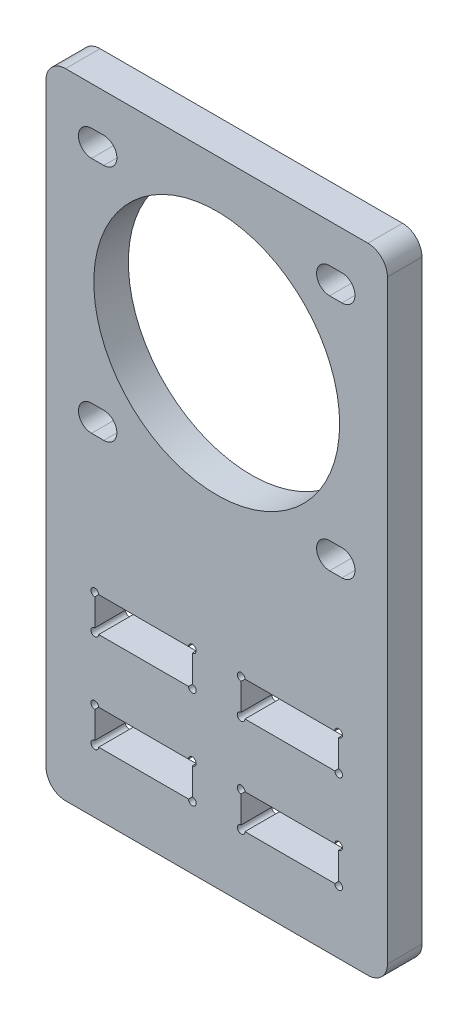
ISO-10303-21;
HEADER;
FILE_DESCRIPTION(('STEP AP214'),'2;1');
FILE_NAME('part.step','',(''),(''),'','','');
FILE_SCHEMA(('AUTOMOTIVE_DESIGN { 1 0 10303 214 1 1 1 1 }'));
ENDSEC;
DATA;
#1=APPLICATION_CONTEXT('core data for automotive mechanical design processes');
#2=APPLICATION_PROTOCOL_DEFINITION('international standard','automotive_design',2000,#1);
#3=PRODUCT_CONTEXT('',#1,'mechanical');
#4=PRODUCT('Part','Part','',(#3));
#5=PRODUCT_RELATED_PRODUCT_CATEGORY('part','',(#4));
#6=PRODUCT_DEFINITION_FORMATION('','',#4);
#7=PRODUCT_DEFINITION_CONTEXT('part definition',#1,'design');
#8=PRODUCT_DEFINITION('design','',#6,#7);
#9=PRODUCT_DEFINITION_SHAPE('','',#8);
#10=(LENGTH_UNIT() NAMED_UNIT(*) SI_UNIT(.MILLI.,.METRE.));
#11=(NAMED_UNIT(*) PLANE_ANGLE_UNIT() SI_UNIT($,.RADIAN.));
#12=(NAMED_UNIT(*) SI_UNIT($,.STERADIAN.) SOLID_ANGLE_UNIT());
#13=UNCERTAINTY_MEASURE_WITH_UNIT(LENGTH_MEASURE(1.E-05),#10,'distance_accuracy_value','');
#14=(GEOMETRIC_REPRESENTATION_CONTEXT(3) GLOBAL_UNCERTAINTY_ASSIGNED_CONTEXT((#13)) GLOBAL_UNIT_ASSIGNED_CONTEXT((#10,
#11,#12)) REPRESENTATION_CONTEXT('',''));
#15=CARTESIAN_POINT('',(0.,0.,0.));
#16=DIRECTION('',(0.,0.,1.));
#17=DIRECTION('',(1.,0.,0.));
#18=AXIS2_PLACEMENT_3D('',#15,#16,#17);
#19=CARTESIAN_POINT('',(0.,0.,4.5));
#20=DIRECTION('',(0.,0.,-1.));
#21=DIRECTION('',(-1.,0.,0.));
#22=AXIS2_PLACEMENT_3D('',#19,#20,#21);
#23=PLANE('',#22);
#24=DIRECTION('',(0.,-1.,0.));
#25=VECTOR('',#24,1.);
#26=CARTESIAN_POINT('',(38.1,0.,4.5));
#27=LINE('',#26,#25);
#28=CARTESIAN_POINT('',(38.1,12.2,4.5));
#29=VERTEX_POINT('',#28);
#30=CARTESIAN_POINT('',(38.1,8.7,4.5));
#31=VERTEX_POINT('',#30);
#32=EDGE_CURVE('E735',#29,#31,#27,.T.);
#33=ORIENTED_EDGE('',*,*,#32,.T.);
#34=CARTESIAN_POINT('',(38.1,8.2,4.5));
#35=DIRECTION('',(0.,0.,1.));
#36=DIRECTION('',(1.,0.,0.));
#37=AXIS2_PLACEMENT_3D('',#34,#35,#36);
#38=CIRCLE('',#37,0.499999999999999);
#39=CARTESIAN_POINT('',(37.6,8.2,4.5));
#40=VERTEX_POINT('',#39);
#41=EDGE_CURVE('E750',#31,#40,#38,.F.);
#42=ORIENTED_EDGE('',*,*,#41,.T.);
#43=DIRECTION('',(-1.,0.,0.));
#44=VECTOR('',#43,1.);
#45=CARTESIAN_POINT('',(0.,8.19999999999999,4.5));
#46=LINE('',#45,#44);
#47=CARTESIAN_POINT('',(25.9,8.2,4.5));
#48=VERTEX_POINT('',#47);
#49=EDGE_CURVE('E787',#40,#48,#46,.T.);
#50=ORIENTED_EDGE('',*,*,#49,.T.);
#51=CARTESIAN_POINT('',(25.4,8.2,4.5));
#52=DIRECTION('',(0.,0.,1.));
#53=DIRECTION('',(1.,0.,0.));
#54=AXIS2_PLACEMENT_3D('',#51,#52,#53);
#55=CIRCLE('',#54,0.5);
#56=CARTESIAN_POINT('',(25.4,8.7,4.5));
#57=VERTEX_POINT('',#56);
#58=EDGE_CURVE('E784',#57,#48,#55,.T.);
#59=ORIENTED_EDGE('',*,*,#58,.F.);
#60=DIRECTION('',(0.,-1.,0.));
#61=VECTOR('',#60,1.);
#62=CARTESIAN_POINT('',(25.4,0.,4.5));
#63=LINE('',#62,#61);
#64=CARTESIAN_POINT('',(25.4,12.2,4.5));
#65=VERTEX_POINT('',#64);
#66=EDGE_CURVE('E781',#65,#57,#63,.T.);
#67=ORIENTED_EDGE('',*,*,#66,.F.);
#68=CARTESIAN_POINT('',(25.4,12.7,4.5));
#69=DIRECTION('',(0.,0.,1.));
#70=DIRECTION('',(1.,0.,0.));
#71=AXIS2_PLACEMENT_3D('',#68,#69,#70);
#72=CIRCLE('',#71,0.5);
#73=CARTESIAN_POINT('',(25.9,12.7,4.5));
#74=VERTEX_POINT('',#73);
#75=EDGE_CURVE('E778',#74,#65,#72,.T.);
#76=ORIENTED_EDGE('',*,*,#75,.F.);
#77=DIRECTION('',(-1.,0.,0.));
#78=VECTOR('',#77,1.);
#79=CARTESIAN_POINT('',(0.,12.7,4.5));
#80=LINE('',#79,#78);
#81=CARTESIAN_POINT('',(37.6,12.7,4.5));
#82=VERTEX_POINT('',#81);
#83=EDGE_CURVE('E775',#82,#74,#80,.T.);
#84=ORIENTED_EDGE('',*,*,#83,.F.);
#85=CARTESIAN_POINT('',(38.1,12.7,4.5));
#86=DIRECTION('',(0.,0.,1.));
#87=DIRECTION('',(1.,0.,0.));
#88=AXIS2_PLACEMENT_3D('',#85,#86,#87);
#89=CIRCLE('',#88,0.500000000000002);
#90=EDGE_CURVE('E772',#29,#82,#89,.T.);
#91=ORIENTED_EDGE('',*,*,#90,.F.);
#92=EDGE_LOOP('',(#33,#42,#50,#59,#67,#76,#84,#91));
#93=FACE_BOUND('',#92,.T.);
#94=DIRECTION('',(-1.,0.,0.));
#95=VECTOR('',#94,1.);
#96=CARTESIAN_POINT('',(0.,25.4,4.5));
#97=LINE('',#96,#95);
#98=CARTESIAN_POINT('',(37.6,25.4,4.5));
#99=VERTEX_POINT('',#98);
#100=CARTESIAN_POINT('',(25.9,25.4,4.5));
#101=VERTEX_POINT('',#100);
#102=EDGE_CURVE('E834',#99,#101,#97,.T.);
#103=ORIENTED_EDGE('',*,*,#102,.F.);
#104=CARTESIAN_POINT('',(38.1,25.4,4.5));
#105=DIRECTION('',(0.,0.,1.));
#106=DIRECTION('',(1.,0.,0.));
#107=AXIS2_PLACEMENT_3D('',#104,#105,#106);
#108=CIRCLE('',#107,0.500000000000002);
#109=CARTESIAN_POINT('',(38.1,24.9,4.5));
#110=VERTEX_POINT('',#109);
#111=EDGE_CURVE('E795',#110,#99,#108,.T.);
#112=ORIENTED_EDGE('',*,*,#111,.F.);
#113=DIRECTION('',(0.,-1.,0.));
#114=VECTOR('',#113,1.);
#115=CARTESIAN_POINT('',(38.1,0.,4.5));
#116=LINE('',#115,#114);
#117=CARTESIAN_POINT('',(38.1,21.4,4.5));
#118=VERTEX_POINT('',#117);
#119=EDGE_CURVE('E814',#110,#118,#116,.T.);
#120=ORIENTED_EDGE('',*,*,#119,.T.);
#121=CARTESIAN_POINT('',(38.1,20.9,4.5));
#122=DIRECTION('',(0.,0.,1.));
#123=DIRECTION('',(1.,0.,0.));
#124=AXIS2_PLACEMENT_3D('',#121,#122,#123);
#125=CIRCLE('',#124,0.499999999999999);
#126=CARTESIAN_POINT('',(37.6,20.9,4.5));
#127=VERTEX_POINT('',#126);
#128=EDGE_CURVE('E849',#118,#127,#125,.F.);
#129=ORIENTED_EDGE('',*,*,#128,.T.);
#130=DIRECTION('',(-1.,0.,0.));
#131=VECTOR('',#130,1.);
#132=CARTESIAN_POINT('',(0.,20.9,4.5));
#133=LINE('',#132,#131);
#134=CARTESIAN_POINT('',(25.9,20.9,4.5));
#135=VERTEX_POINT('',#134);
#136=EDGE_CURVE('E846',#127,#135,#133,.T.);
#137=ORIENTED_EDGE('',*,*,#136,.T.);
#138=CARTESIAN_POINT('',(25.4,20.9,4.5));
#139=DIRECTION('',(0.,0.,1.));
#140=DIRECTION('',(1.,0.,0.));
#141=AXIS2_PLACEMENT_3D('',#138,#139,#140);
#142=CIRCLE('',#141,0.5);
#143=CARTESIAN_POINT('',(25.4,21.4,4.5));
#144=VERTEX_POINT('',#143);
#145=EDGE_CURVE('E843',#144,#135,#142,.T.);
#146=ORIENTED_EDGE('',*,*,#145,.F.);
#147=DIRECTION('',(0.,-1.,0.));
#148=VECTOR('',#147,1.);
#149=CARTESIAN_POINT('',(25.4,0.,4.5));
#150=LINE('',#149,#148);
#151=CARTESIAN_POINT('',(25.4,24.9,4.5));
#152=VERTEX_POINT('',#151);
#153=EDGE_CURVE('E840',#152,#144,#150,.T.);
#154=ORIENTED_EDGE('',*,*,#153,.F.);
#155=CARTESIAN_POINT('',(25.4,25.4,4.5));
#156=DIRECTION('',(0.,0.,1.));
#157=DIRECTION('',(1.,0.,0.));
#158=AXIS2_PLACEMENT_3D('',#155,#156,#157);
#159=CIRCLE('',#158,0.5);
#160=EDGE_CURVE('E837',#101,#152,#159,.T.);
#161=ORIENTED_EDGE('',*,*,#160,.F.);
#162=EDGE_LOOP('',(#103,#112,#120,#129,#137,#146,#154,#161));
#163=FACE_BOUND('',#162,.T.);
#164=DIRECTION('',(0.,-1.,0.));
#165=VECTOR('',#164,1.);
#166=CARTESIAN_POINT('',(0.,0.,4.5));
#167=LINE('',#166,#165);
#168=CARTESIAN_POINT('',(0.,80.01,4.5));
#169=VERTEX_POINT('',#168);
#170=CARTESIAN_POINT('',(0.,2.54,4.5));
#171=VERTEX_POINT('',#170);
#172=EDGE_CURVE('E1020',#169,#171,#167,.T.);
#173=ORIENTED_EDGE('',*,*,#172,.T.);
#174=CARTESIAN_POINT('',(2.54,2.54,4.5));
#175=DIRECTION('',(0.,0.,-1.));
#176=DIRECTION('',(-1.,0.,0.));
#177=AXIS2_PLACEMENT_3D('',#174,#175,#176);
#178=CIRCLE('',#177,2.54);
#179=CARTESIAN_POINT('',(2.54,0.,4.5));
#180=VERTEX_POINT('',#179);
#181=EDGE_CURVE('E1103',#171,#180,#178,.F.);
#182=ORIENTED_EDGE('',*,*,#181,.T.);
#183=DIRECTION('',(1.,0.,0.));
#184=VECTOR('',#183,1.);
#185=CARTESIAN_POINT('',(0.,0.,4.5));
#186=LINE('',#185,#184);
#187=CARTESIAN_POINT('',(41.91,0.,4.5));
#188=VERTEX_POINT('',#187);
#189=EDGE_CURVE('E1023',#180,#188,#186,.T.);
#190=ORIENTED_EDGE('',*,*,#189,.T.);
#191=CARTESIAN_POINT('',(41.91,2.54,4.5));
#192=DIRECTION('',(0.,0.,-1.));
#193=DIRECTION('',(-1.,0.,0.));
#194=AXIS2_PLACEMENT_3D('',#191,#192,#193);
#195=CIRCLE('',#194,2.54);
#196=CARTESIAN_POINT('',(44.45,2.54,4.5));
#197=VERTEX_POINT('',#196);
#198=EDGE_CURVE('E1101',#188,#197,#195,.F.);
#199=ORIENTED_EDGE('',*,*,#198,.T.);
#200=DIRECTION('',(0.,1.,0.));
#201=VECTOR('',#200,1.);
#202=CARTESIAN_POINT('',(44.45,0.,4.5));
#203=LINE('',#202,#201);
#204=CARTESIAN_POINT('',(44.45,80.01,4.5));
#205=VERTEX_POINT('',#204);
#206=EDGE_CURVE('E1027',#197,#205,#203,.T.);
#207=ORIENTED_EDGE('',*,*,#206,.T.);
#208=CARTESIAN_POINT('',(41.91,80.01,4.5));
#209=DIRECTION('',(0.,0.,-1.));
#210=DIRECTION('',(-1.,0.,0.));
#211=AXIS2_PLACEMENT_3D('',#208,#209,#210);
#212=CIRCLE('',#211,2.54);
#213=CARTESIAN_POINT('',(41.91,82.55,4.5));
#214=VERTEX_POINT('',#213);
#215=EDGE_CURVE('E1097',#205,#214,#212,.F.);
#216=ORIENTED_EDGE('',*,*,#215,.T.);
#217=DIRECTION('',(-1.,0.,0.));
#218=VECTOR('',#217,1.);
#219=CARTESIAN_POINT('',(0.,82.55,4.5));
#220=LINE('',#219,#218);
#221=CARTESIAN_POINT('',(2.53999999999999,82.55,4.5));
#222=VERTEX_POINT('',#221);
#223=EDGE_CURVE('E1030',#214,#222,#220,.T.);
#224=ORIENTED_EDGE('',*,*,#223,.T.);
#225=CARTESIAN_POINT('',(2.53999999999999,80.01,4.5));
#226=DIRECTION('',(0.,0.,-1.));
#227=DIRECTION('',(-1.,0.,0.));
#228=AXIS2_PLACEMENT_3D('',#225,#226,#227);
#229=CIRCLE('',#228,2.54);
#230=EDGE_CURVE('E1099',#222,#169,#229,.F.);
#231=ORIENTED_EDGE('',*,*,#230,.T.);
#232=EDGE_LOOP('',(#173,#182,#190,#199,#207,#216,#224,#231));
#233=FACE_BOUND('',#232,.T.);
#234=CARTESIAN_POINT('',(22.225,60.325,4.5));
#235=DIRECTION('',(0.,0.,1.));
#236=DIRECTION('',(1.,0.,0.));
#237=AXIS2_PLACEMENT_3D('',#234,#235,#236);
#238=CIRCLE('',#237,16.002);
#239=CARTESIAN_POINT('',(38.227,60.325,4.5));
#240=VERTEX_POINT('',#239);
#241=EDGE_CURVE('E1013',#240,#240,#238,.T.);
#242=ORIENTED_EDGE('',*,*,#241,.F.);
#243=EDGE_LOOP('',(#242));
#244=FACE_BOUND('',#243,.T.);
#245=DIRECTION('',(1.,0.,0.));
#246=VECTOR('',#245,1.);
#247=CARTESIAN_POINT('',(36.925,46.525,4.5));
#248=LINE('',#247,#246);
#249=CARTESIAN_POINT('',(36.925,46.525,4.5));
#250=VERTEX_POINT('',#249);
#251=CARTESIAN_POINT('',(38.525,46.525,4.5));
#252=VERTEX_POINT('',#251);
#253=EDGE_CURVE('E995',#250,#252,#248,.T.);
#254=ORIENTED_EDGE('',*,*,#253,.T.);
#255=CARTESIAN_POINT('',(38.525,44.825,4.5));
#256=DIRECTION('',(0.,0.,1.));
#257=DIRECTION('',(1.,0.,0.));
#258=AXIS2_PLACEMENT_3D('',#255,#256,#257);
#259=CIRCLE('',#258,1.69999999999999);
#260=CARTESIAN_POINT('',(38.525,43.125,4.5));
#261=VERTEX_POINT('',#260);
#262=EDGE_CURVE('E1006',#261,#252,#259,.T.);
#263=ORIENTED_EDGE('',*,*,#262,.F.);
#264=DIRECTION('',(1.,0.,0.));
#265=VECTOR('',#264,1.);
#266=CARTESIAN_POINT('',(36.925,43.125,4.5));
#267=LINE('',#266,#265);
#268=CARTESIAN_POINT('',(36.925,43.125,4.5));
#269=VERTEX_POINT('',#268);
#270=EDGE_CURVE('E993',#269,#261,#267,.T.);
#271=ORIENTED_EDGE('',*,*,#270,.F.);
#272=CARTESIAN_POINT('',(36.925,44.825,4.5));
#273=DIRECTION('',(0.,0.,1.));
#274=DIRECTION('',(1.,0.,0.));
#275=AXIS2_PLACEMENT_3D('',#272,#273,#274);
#276=CIRCLE('',#275,1.69999999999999);
#277=EDGE_CURVE('E998',#250,#269,#276,.T.);
#278=ORIENTED_EDGE('',*,*,#277,.F.);
#279=EDGE_LOOP('',(#254,#263,#271,#278));
#280=FACE_BOUND('',#279,.T.);
#281=CARTESIAN_POINT('',(36.925,75.825,4.5));
#282=DIRECTION('',(0.,0.,1.));
#283=DIRECTION('',(1.,0.,0.));
#284=AXIS2_PLACEMENT_3D('',#281,#282,#283);
#285=CIRCLE('',#284,1.69999999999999);
#286=CARTESIAN_POINT('',(36.925,77.525,4.5));
#287=VERTEX_POINT('',#286);
#288=CARTESIAN_POINT('',(36.925,74.125,4.5));
#289=VERTEX_POINT('',#288);
#290=EDGE_CURVE('E978',#287,#289,#285,.T.);
#291=ORIENTED_EDGE('',*,*,#290,.F.);
#292=DIRECTION('',(1.,0.,0.));
#293=VECTOR('',#292,1.);
#294=CARTESIAN_POINT('',(36.925,77.525,4.5));
#295=LINE('',#294,#293);
#296=CARTESIAN_POINT('',(38.525,77.525,4.5));
#297=VERTEX_POINT('',#296);
#298=EDGE_CURVE('E975',#287,#297,#295,.T.);
#299=ORIENTED_EDGE('',*,*,#298,.T.);
#300=CARTESIAN_POINT('',(38.525,75.825,4.5));
#301=DIRECTION('',(0.,0.,1.));
#302=DIRECTION('',(1.,0.,0.));
#303=AXIS2_PLACEMENT_3D('',#300,#301,#302);
#304=CIRCLE('',#303,1.69999999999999);
#305=CARTESIAN_POINT('',(38.525,74.125,4.5));
#306=VERTEX_POINT('',#305);
#307=EDGE_CURVE('E986',#306,#297,#304,.T.);
#308=ORIENTED_EDGE('',*,*,#307,.F.);
#309=DIRECTION('',(1.,0.,0.));
#310=VECTOR('',#309,1.);
#311=CARTESIAN_POINT('',(36.925,74.125,4.5));
#312=LINE('',#311,#310);
#313=EDGE_CURVE('E973',#289,#306,#312,.T.);
#314=ORIENTED_EDGE('',*,*,#313,.F.);
#315=EDGE_LOOP('',(#291,#299,#308,#314));
#316=FACE_BOUND('',#315,.T.);
#317=CARTESIAN_POINT('',(5.92499999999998,75.825,4.5));
#318=DIRECTION('',(0.,0.,1.));
#319=DIRECTION('',(1.,0.,0.));
#320=AXIS2_PLACEMENT_3D('',#317,#318,#319);
#321=CIRCLE('',#320,1.7);
#322=CARTESIAN_POINT('',(5.92499999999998,77.525,4.5));
#323=VERTEX_POINT('',#322);
#324=CARTESIAN_POINT('',(5.92499999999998,74.125,4.5));
#325=VERTEX_POINT('',#324);
#326=EDGE_CURVE('E958',#323,#325,#321,.T.);
#327=ORIENTED_EDGE('',*,*,#326,.F.);
#328=DIRECTION('',(1.,0.,0.));
#329=VECTOR('',#328,1.);
#330=CARTESIAN_POINT('',(5.92499999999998,77.525,4.5));
#331=LINE('',#330,#329);
#332=CARTESIAN_POINT('',(7.52499999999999,77.525,4.5));
#333=VERTEX_POINT('',#332);
#334=EDGE_CURVE('E955',#323,#333,#331,.T.);
#335=ORIENTED_EDGE('',*,*,#334,.T.);
#336=CARTESIAN_POINT('',(7.52499999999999,75.825,4.5));
#337=DIRECTION('',(0.,0.,1.));
#338=DIRECTION('',(1.,0.,0.));
#339=AXIS2_PLACEMENT_3D('',#336,#337,#338);
#340=CIRCLE('',#339,1.7);
#341=CARTESIAN_POINT('',(7.52499999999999,74.125,4.5));
#342=VERTEX_POINT('',#341);
#343=EDGE_CURVE('E966',#342,#333,#340,.T.);
#344=ORIENTED_EDGE('',*,*,#343,.F.);
#345=DIRECTION('',(1.,0.,0.));
#346=VECTOR('',#345,1.);
#347=CARTESIAN_POINT('',(5.92499999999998,74.125,4.5));
#348=LINE('',#347,#346);
#349=EDGE_CURVE('E953',#325,#342,#348,.T.);
#350=ORIENTED_EDGE('',*,*,#349,.F.);
#351=EDGE_LOOP('',(#327,#335,#344,#350));
#352=FACE_BOUND('',#351,.T.);
#353=CARTESIAN_POINT('',(5.92499999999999,44.825,4.5));
#354=DIRECTION('',(0.,0.,1.));
#355=DIRECTION('',(1.,0.,0.));
#356=AXIS2_PLACEMENT_3D('',#353,#354,#355);
#357=CIRCLE('',#356,1.7);
#358=CARTESIAN_POINT('',(5.92499999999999,46.525,4.5));
#359=VERTEX_POINT('',#358);
#360=CARTESIAN_POINT('',(5.92499999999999,43.125,4.5));
#361=VERTEX_POINT('',#360);
#362=EDGE_CURVE('E938',#359,#361,#357,.T.);
#363=ORIENTED_EDGE('',*,*,#362,.F.);
#364=DIRECTION('',(1.,0.,0.));
#365=VECTOR('',#364,1.);
#366=CARTESIAN_POINT('',(5.92499999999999,46.525,4.5));
#367=LINE('',#366,#365);
#368=CARTESIAN_POINT('',(7.52499999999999,46.525,4.5));
#369=VERTEX_POINT('',#368);
#370=EDGE_CURVE('E935',#359,#369,#367,.T.);
#371=ORIENTED_EDGE('',*,*,#370,.T.);
#372=CARTESIAN_POINT('',(7.52499999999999,44.825,4.5));
#373=DIRECTION('',(0.,0.,1.));
#374=DIRECTION('',(1.,0.,0.));
#375=AXIS2_PLACEMENT_3D('',#372,#373,#374);
#376=CIRCLE('',#375,1.7);
#377=CARTESIAN_POINT('',(7.52499999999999,43.125,4.5));
#378=VERTEX_POINT('',#377);
#379=EDGE_CURVE('E946',#378,#369,#376,.T.);
#380=ORIENTED_EDGE('',*,*,#379,.F.);
#381=DIRECTION('',(1.,0.,0.));
#382=VECTOR('',#381,1.);
#383=CARTESIAN_POINT('',(5.92499999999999,43.125,4.5));
#384=LINE('',#383,#382);
#385=EDGE_CURVE('E919',#361,#378,#384,.T.);
#386=ORIENTED_EDGE('',*,*,#385,.F.);
#387=EDGE_LOOP('',(#363,#371,#380,#386));
#388=FACE_BOUND('',#387,.T.);
#389=DIRECTION('',(0.,-1.,0.));
#390=VECTOR('',#389,1.);
#391=CARTESIAN_POINT('',(19.05,0.,4.5));
#392=LINE('',#391,#390);
#393=CARTESIAN_POINT('',(19.05,24.9,4.5));
#394=VERTEX_POINT('',#393);
#395=CARTESIAN_POINT('',(19.05,21.4,4.5));
#396=VERTEX_POINT('',#395);
#397=EDGE_CURVE('E856',#394,#396,#392,.T.);
#398=ORIENTED_EDGE('',*,*,#397,.T.);
#399=CARTESIAN_POINT('',(19.05,20.9,4.5));
#400=DIRECTION('',(0.,0.,1.));
#401=DIRECTION('',(1.,0.,0.));
#402=AXIS2_PLACEMENT_3D('',#399,#400,#401);
#403=CIRCLE('',#402,0.5);
#404=CARTESIAN_POINT('',(18.55,20.9,4.5));
#405=VERTEX_POINT('',#404);
#406=EDGE_CURVE('E874',#396,#405,#403,.F.);
#407=ORIENTED_EDGE('',*,*,#406,.T.);
#408=DIRECTION('',(1.,0.,0.));
#409=VECTOR('',#408,1.);
#410=CARTESIAN_POINT('',(0.,20.9,4.5));
#411=LINE('',#410,#409);
#412=CARTESIAN_POINT('',(6.85,20.9,4.5));
#413=VERTEX_POINT('',#412);
#414=EDGE_CURVE('E911',#413,#405,#411,.T.);
#415=ORIENTED_EDGE('',*,*,#414,.F.);
#416=CARTESIAN_POINT('',(6.34999999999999,20.9,4.5));
#417=DIRECTION('',(0.,0.,1.));
#418=DIRECTION('',(1.,0.,0.));
#419=AXIS2_PLACEMENT_3D('',#416,#417,#418);
#420=CIRCLE('',#419,0.500000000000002);
#421=CARTESIAN_POINT('',(6.34999999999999,21.4,4.5));
#422=VERTEX_POINT('',#421);
#423=EDGE_CURVE('E908',#413,#422,#420,.F.);
#424=ORIENTED_EDGE('',*,*,#423,.T.);
#425=DIRECTION('',(0.,-1.,0.));
#426=VECTOR('',#425,1.);
#427=CARTESIAN_POINT('',(6.35,0.,4.5));
#428=LINE('',#427,#426);
#429=CARTESIAN_POINT('',(6.34999999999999,24.9,4.5));
#430=VERTEX_POINT('',#429);
#431=EDGE_CURVE('E905',#430,#422,#428,.T.);
#432=ORIENTED_EDGE('',*,*,#431,.F.);
#433=CARTESIAN_POINT('',(6.34999999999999,25.4,4.5));
#434=DIRECTION('',(0.,0.,1.));
#435=DIRECTION('',(1.,0.,0.));
#436=AXIS2_PLACEMENT_3D('',#433,#434,#435);
#437=CIRCLE('',#436,0.5);
#438=CARTESIAN_POINT('',(6.84999999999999,25.4,4.5));
#439=VERTEX_POINT('',#438);
#440=EDGE_CURVE('E902',#439,#430,#437,.T.);
#441=ORIENTED_EDGE('',*,*,#440,.F.);
#442=DIRECTION('',(1.,0.,0.));
#443=VECTOR('',#442,1.);
#444=CARTESIAN_POINT('',(0.,25.4,4.5));
#445=LINE('',#444,#443);
#446=CARTESIAN_POINT('',(18.55,25.4,4.5));
#447=VERTEX_POINT('',#446);
#448=EDGE_CURVE('E899',#439,#447,#445,.T.);
#449=ORIENTED_EDGE('',*,*,#448,.T.);
#450=CARTESIAN_POINT('',(19.05,25.4,4.5));
#451=DIRECTION('',(0.,0.,1.));
#452=DIRECTION('',(1.,0.,0.));
#453=AXIS2_PLACEMENT_3D('',#450,#451,#452);
#454=CIRCLE('',#453,0.5);
#455=EDGE_CURVE('E896',#394,#447,#454,.T.);
#456=ORIENTED_EDGE('',*,*,#455,.F.);
#457=EDGE_LOOP('',(#398,#407,#415,#424,#432,#441,#449,#456));
#458=FACE_BOUND('',#457,.T.);
#459=DIRECTION('',(0.,-1.,0.));
#460=VECTOR('',#459,1.);
#461=CARTESIAN_POINT('',(19.05,0.,4.5));
#462=LINE('',#461,#460);
#463=CARTESIAN_POINT('',(19.05,12.2,4.5));
#464=VERTEX_POINT('',#463);
#465=CARTESIAN_POINT('',(19.05,8.7,4.5));
#466=VERTEX_POINT('',#465);
#467=EDGE_CURVE('E344',#464,#466,#462,.T.);
#468=ORIENTED_EDGE('',*,*,#467,.T.);
#469=CARTESIAN_POINT('',(19.05,8.2,4.5));
#470=DIRECTION('',(0.,0.,1.));
#471=DIRECTION('',(1.,0.,0.));
#472=AXIS2_PLACEMENT_3D('',#469,#470,#471);
#473=CIRCLE('',#472,0.5);
#474=CARTESIAN_POINT('',(18.55,8.2,4.5));
#475=VERTEX_POINT('',#474);
#476=EDGE_CURVE('E698',#466,#475,#473,.F.);
#477=ORIENTED_EDGE('',*,*,#476,.T.);
#478=DIRECTION('',(1.,0.,0.));
#479=VECTOR('',#478,1.);
#480=CARTESIAN_POINT('',(0.,8.2,4.5));
#481=LINE('',#480,#479);
#482=CARTESIAN_POINT('',(6.85,8.2,4.5));
#483=VERTEX_POINT('',#482);
#484=EDGE_CURVE('E701',#483,#475,#481,.T.);
#485=ORIENTED_EDGE('',*,*,#484,.F.);
#486=CARTESIAN_POINT('',(6.34999999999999,8.2,4.5));
#487=DIRECTION('',(0.,0.,1.));
#488=DIRECTION('',(1.,0.,0.));
#489=AXIS2_PLACEMENT_3D('',#486,#487,#488);
#490=CIRCLE('',#489,0.500000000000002);
#491=CARTESIAN_POINT('',(6.35,8.7,4.5));
#492=VERTEX_POINT('',#491);
#493=EDGE_CURVE('E728',#483,#492,#490,.F.);
#494=ORIENTED_EDGE('',*,*,#493,.T.);
#495=DIRECTION('',(0.,-1.,0.));
#496=VECTOR('',#495,1.);
#497=CARTESIAN_POINT('',(6.35,0.,4.5));
#498=LINE('',#497,#496);
#499=CARTESIAN_POINT('',(6.34999999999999,12.2,4.5));
#500=VERTEX_POINT('',#499);
#501=EDGE_CURVE('E725',#500,#492,#498,.T.);
#502=ORIENTED_EDGE('',*,*,#501,.F.);
#503=CARTESIAN_POINT('',(6.34999999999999,12.7,4.5));
#504=DIRECTION('',(0.,0.,1.));
#505=DIRECTION('',(1.,0.,0.));
#506=AXIS2_PLACEMENT_3D('',#503,#504,#505);
#507=CIRCLE('',#506,0.5);
#508=CARTESIAN_POINT('',(6.84999999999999,12.7,4.5));
#509=VERTEX_POINT('',#508);
#510=EDGE_CURVE('E722',#509,#500,#507,.T.);
#511=ORIENTED_EDGE('',*,*,#510,.F.);
#512=DIRECTION('',(1.,0.,0.));
#513=VECTOR('',#512,1.);
#514=CARTESIAN_POINT('',(0.,12.7,4.5));
#515=LINE('',#514,#513);
#516=CARTESIAN_POINT('',(18.55,12.7,4.5));
#517=VERTEX_POINT('',#516);
#518=EDGE_CURVE('E719',#509,#517,#515,.T.);
#519=ORIENTED_EDGE('',*,*,#518,.T.);
#520=CARTESIAN_POINT('',(19.05,12.7,4.5));
#521=DIRECTION('',(0.,0.,1.));
#522=DIRECTION('',(1.,0.,0.));
#523=AXIS2_PLACEMENT_3D('',#520,#521,#522);
#524=CIRCLE('',#523,0.5);
#525=EDGE_CURVE('E717',#464,#517,#524,.T.);
#526=ORIENTED_EDGE('',*,*,#525,.F.);
#527=EDGE_LOOP('',(#468,#477,#485,#494,#502,#511,#519,#526));
#528=FACE_BOUND('',#527,.T.);
#529=ADVANCED_FACE('F329',(#93,#163,#233,#244,#280,#316,#352,#388,#458,#528),#23,.F.);
#530=CARTESIAN_POINT('',(0.,0.,0.));
#531=DIRECTION('',(0.,0.,-1.));
#532=DIRECTION('',(-1.,0.,0.));
#533=AXIS2_PLACEMENT_3D('',#530,#531,#532);
#534=PLANE('',#533);
#535=CARTESIAN_POINT('',(38.1,25.4,0.));
#536=DIRECTION('',(0.,0.,1.));
#537=DIRECTION('',(1.,0.,0.));
#538=AXIS2_PLACEMENT_3D('',#535,#536,#537);
#539=CIRCLE('',#538,0.500000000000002);
#540=CARTESIAN_POINT('',(38.1,24.9,0.));
#541=VERTEX_POINT('',#540);
#542=CARTESIAN_POINT('',(37.6,25.4,0.));
#543=VERTEX_POINT('',#542);
#544=EDGE_CURVE('E810',#541,#543,#539,.T.);
#545=ORIENTED_EDGE('',*,*,#544,.T.);
#546=DIRECTION('',(-1.,0.,0.));
#547=VECTOR('',#546,1.);
#548=CARTESIAN_POINT('',(0.,25.4,0.));
#549=LINE('',#548,#547);
#550=CARTESIAN_POINT('',(25.9,25.4,0.));
#551=VERTEX_POINT('',#550);
#552=EDGE_CURVE('E813',#543,#551,#549,.T.);
#553=ORIENTED_EDGE('',*,*,#552,.T.);
#554=CARTESIAN_POINT('',(25.4,25.4,0.));
#555=DIRECTION('',(0.,0.,1.));
#556=DIRECTION('',(1.,0.,0.));
#557=AXIS2_PLACEMENT_3D('',#554,#555,#556);
#558=CIRCLE('',#557,0.5);
#559=CARTESIAN_POINT('',(25.4,24.9,0.));
#560=VERTEX_POINT('',#559);
#561=EDGE_CURVE('E817',#551,#560,#558,.T.);
#562=ORIENTED_EDGE('',*,*,#561,.T.);
#563=DIRECTION('',(0.,-1.,0.));
#564=VECTOR('',#563,1.);
#565=CARTESIAN_POINT('',(25.4,0.,0.));
#566=LINE('',#565,#564);
#567=CARTESIAN_POINT('',(25.4,21.4,0.));
#568=VERTEX_POINT('',#567);
#569=EDGE_CURVE('E820',#560,#568,#566,.T.);
#570=ORIENTED_EDGE('',*,*,#569,.T.);
#571=CARTESIAN_POINT('',(25.4,20.9,0.));
#572=DIRECTION('',(0.,0.,1.));
#573=DIRECTION('',(1.,0.,0.));
#574=AXIS2_PLACEMENT_3D('',#571,#572,#573);
#575=CIRCLE('',#574,0.5);
#576=CARTESIAN_POINT('',(25.9,20.9,0.));
#577=VERTEX_POINT('',#576);
#578=EDGE_CURVE('E823',#568,#577,#575,.T.);
#579=ORIENTED_EDGE('',*,*,#578,.T.);
#580=DIRECTION('',(-1.,0.,0.));
#581=VECTOR('',#580,1.);
#582=CARTESIAN_POINT('',(0.,20.9,0.));
#583=LINE('',#582,#581);
#584=CARTESIAN_POINT('',(37.6,20.9,0.));
#585=VERTEX_POINT('',#584);
#586=EDGE_CURVE('E826',#585,#577,#583,.T.);
#587=ORIENTED_EDGE('',*,*,#586,.F.);
#588=CARTESIAN_POINT('',(38.1,20.9,0.));
#589=DIRECTION('',(0.,0.,1.));
#590=DIRECTION('',(1.,0.,0.));
#591=AXIS2_PLACEMENT_3D('',#588,#589,#590);
#592=CIRCLE('',#591,0.499999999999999);
#593=CARTESIAN_POINT('',(38.1,21.4,0.));
#594=VERTEX_POINT('',#593);
#595=EDGE_CURVE('E828',#594,#585,#592,.F.);
#596=ORIENTED_EDGE('',*,*,#595,.F.);
#597=DIRECTION('',(0.,-1.,0.));
#598=VECTOR('',#597,1.);
#599=CARTESIAN_POINT('',(38.1,0.,0.));
#600=LINE('',#599,#598);
#601=EDGE_CURVE('E830',#541,#594,#600,.T.);
#602=ORIENTED_EDGE('',*,*,#601,.F.);
#603=EDGE_LOOP('',(#545,#553,#562,#570,#579,#587,#596,#602));
#604=FACE_BOUND('',#603,.T.);
#605=DIRECTION('',(1.,0.,0.));
#606=VECTOR('',#605,1.);
#607=CARTESIAN_POINT('',(0.,46.525,0.));
#608=LINE('',#607,#606);
#609=CARTESIAN_POINT('',(5.92499999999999,46.525,0.));
#610=VERTEX_POINT('',#609);
#611=CARTESIAN_POINT('',(7.52499999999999,46.525,0.));
#612=VERTEX_POINT('',#611);
#613=EDGE_CURVE('E1077',#610,#612,#608,.T.);
#614=ORIENTED_EDGE('',*,*,#613,.F.);
#615=CARTESIAN_POINT('',(5.92499999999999,44.825,0.));
#616=DIRECTION('',(0.,0.,-1.));
#617=DIRECTION('',(-1.,0.,0.));
#618=AXIS2_PLACEMENT_3D('',#615,#616,#617);
#619=CIRCLE('',#618,1.69999999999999);
#620=CARTESIAN_POINT('',(5.92499999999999,43.125,0.));
#621=VERTEX_POINT('',#620);
#622=EDGE_CURVE('E1072',#621,#610,#619,.T.);
#623=ORIENTED_EDGE('',*,*,#622,.F.);
#624=DIRECTION('',(-1.,0.,0.));
#625=VECTOR('',#624,1.);
#626=CARTESIAN_POINT('',(0.,43.125,0.));
#627=LINE('',#626,#625);
#628=CARTESIAN_POINT('',(7.52499999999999,43.125,0.));
#629=VERTEX_POINT('',#628);
#630=EDGE_CURVE('E1070',#629,#621,#627,.T.);
#631=ORIENTED_EDGE('',*,*,#630,.F.);
#632=CARTESIAN_POINT('',(7.52499999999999,44.825,0.));
#633=DIRECTION('',(0.,0.,-1.));
#634=DIRECTION('',(-1.,0.,0.));
#635=AXIS2_PLACEMENT_3D('',#632,#633,#634);
#636=CIRCLE('',#635,1.69999999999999);
#637=EDGE_CURVE('E1074',#612,#629,#636,.T.);
#638=ORIENTED_EDGE('',*,*,#637,.F.);
#639=EDGE_LOOP('',(#614,#623,#631,#638));
#640=FACE_BOUND('',#639,.T.);
#641=DIRECTION('',(1.,0.,0.));
#642=VECTOR('',#641,1.);
#643=CARTESIAN_POINT('',(0.,77.525,0.));
#644=LINE('',#643,#642);
#645=CARTESIAN_POINT('',(5.92499999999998,77.525,0.));
#646=VERTEX_POINT('',#645);
#647=CARTESIAN_POINT('',(7.52499999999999,77.525,0.));
#648=VERTEX_POINT('',#647);
#649=EDGE_CURVE('E1068',#646,#648,#644,.T.);
#650=ORIENTED_EDGE('',*,*,#649,.F.);
#651=CARTESIAN_POINT('',(5.92499999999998,75.825,0.));
#652=DIRECTION('',(0.,0.,-1.));
#653=DIRECTION('',(-1.,0.,0.));
#654=AXIS2_PLACEMENT_3D('',#651,#652,#653);
#655=CIRCLE('',#654,1.69999999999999);
#656=CARTESIAN_POINT('',(5.92499999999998,74.125,0.));
#657=VERTEX_POINT('',#656);
#658=EDGE_CURVE('E1063',#657,#646,#655,.T.);
#659=ORIENTED_EDGE('',*,*,#658,.F.);
#660=DIRECTION('',(-1.,0.,0.));
#661=VECTOR('',#660,1.);
#662=CARTESIAN_POINT('',(0.,74.125,0.));
#663=LINE('',#662,#661);
#664=CARTESIAN_POINT('',(7.52499999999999,74.125,0.));
#665=VERTEX_POINT('',#664);
#666=EDGE_CURVE('E1061',#665,#657,#663,.T.);
#667=ORIENTED_EDGE('',*,*,#666,.F.);
#668=CARTESIAN_POINT('',(7.52499999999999,75.825,0.));
#669=DIRECTION('',(0.,0.,-1.));
#670=DIRECTION('',(-1.,0.,0.));
#671=AXIS2_PLACEMENT_3D('',#668,#669,#670);
#672=CIRCLE('',#671,1.69999999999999);
#673=EDGE_CURVE('E1065',#648,#665,#672,.T.);
#674=ORIENTED_EDGE('',*,*,#673,.F.);
#675=EDGE_LOOP('',(#650,#659,#667,#674));
#676=FACE_BOUND('',#675,.T.);
#677=DIRECTION('',(1.,0.,0.));
#678=VECTOR('',#677,1.);
#679=CARTESIAN_POINT('',(0.,77.525,0.));
#680=LINE('',#679,#678);
#681=CARTESIAN_POINT('',(36.925,77.525,0.));
#682=VERTEX_POINT('',#681);
#683=CARTESIAN_POINT('',(38.525,77.525,0.));
#684=VERTEX_POINT('',#683);
#685=EDGE_CURVE('E1059',#682,#684,#680,.T.);
#686=ORIENTED_EDGE('',*,*,#685,.F.);
#687=CARTESIAN_POINT('',(36.925,75.825,0.));
#688=DIRECTION('',(0.,0.,-1.));
#689=DIRECTION('',(-1.,0.,0.));
#690=AXIS2_PLACEMENT_3D('',#687,#688,#689);
#691=CIRCLE('',#690,1.69999999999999);
#692=CARTESIAN_POINT('',(36.925,74.125,0.));
#693=VERTEX_POINT('',#692);
#694=EDGE_CURVE('E1054',#693,#682,#691,.T.);
#695=ORIENTED_EDGE('',*,*,#694,.F.);
#696=DIRECTION('',(-1.,0.,0.));
#697=VECTOR('',#696,1.);
#698=CARTESIAN_POINT('',(0.,74.125,0.));
#699=LINE('',#698,#697);
#700=CARTESIAN_POINT('',(38.525,74.125,0.));
#701=VERTEX_POINT('',#700);
#702=EDGE_CURVE('E1052',#701,#693,#699,.T.);
#703=ORIENTED_EDGE('',*,*,#702,.F.);
#704=CARTESIAN_POINT('',(38.525,75.825,0.));
#705=DIRECTION('',(0.,0.,-1.));
#706=DIRECTION('',(-1.,0.,0.));
#707=AXIS2_PLACEMENT_3D('',#704,#705,#706);
#708=CIRCLE('',#707,1.69999999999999);
#709=EDGE_CURVE('E1056',#684,#701,#708,.T.);
#710=ORIENTED_EDGE('',*,*,#709,.F.);
#711=EDGE_LOOP('',(#686,#695,#703,#710));
#712=FACE_BOUND('',#711,.T.);
#713=DIRECTION('',(1.,0.,0.));
#714=VECTOR('',#713,1.);
#715=CARTESIAN_POINT('',(0.,46.525,0.));
#716=LINE('',#715,#714);
#717=CARTESIAN_POINT('',(36.925,46.525,0.));
#718=VERTEX_POINT('',#717);
#719=CARTESIAN_POINT('',(38.525,46.525,0.));
#720=VERTEX_POINT('',#719);
#721=EDGE_CURVE('E1050',#718,#720,#716,.T.);
#722=ORIENTED_EDGE('',*,*,#721,.F.);
#723=CARTESIAN_POINT('',(36.925,44.825,0.));
#724=DIRECTION('',(0.,0.,-1.));
#725=DIRECTION('',(-1.,0.,0.));
#726=AXIS2_PLACEMENT_3D('',#723,#724,#725);
#727=CIRCLE('',#726,1.69999999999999);
#728=CARTESIAN_POINT('',(36.925,43.125,0.));
#729=VERTEX_POINT('',#728);
#730=EDGE_CURVE('E1048',#729,#718,#727,.T.);
#731=ORIENTED_EDGE('',*,*,#730,.F.);
#732=DIRECTION('',(-1.,0.,0.));
#733=VECTOR('',#732,1.);
#734=CARTESIAN_POINT('',(0.,43.125,0.));
#735=LINE('',#734,#733);
#736=CARTESIAN_POINT('',(38.525,43.125,0.));
#737=VERTEX_POINT('',#736);
#738=EDGE_CURVE('E1033',#737,#729,#735,.T.);
#739=ORIENTED_EDGE('',*,*,#738,.F.);
#740=CARTESIAN_POINT('',(38.525,44.825,0.));
#741=DIRECTION('',(0.,0.,-1.));
#742=DIRECTION('',(-1.,0.,0.));
#743=AXIS2_PLACEMENT_3D('',#740,#741,#742);
#744=CIRCLE('',#743,1.69999999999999);
#745=EDGE_CURVE('E1045',#720,#737,#744,.T.);
#746=ORIENTED_EDGE('',*,*,#745,.F.);
#747=EDGE_LOOP('',(#722,#731,#739,#746));
#748=FACE_BOUND('',#747,.T.);
#749=CARTESIAN_POINT('',(22.225,60.325,0.));
#750=DIRECTION('',(0.,0.,1.));
#751=DIRECTION('',(1.,0.,0.));
#752=AXIS2_PLACEMENT_3D('',#749,#750,#751);
#753=CIRCLE('',#752,16.002);
#754=CARTESIAN_POINT('',(38.227,60.325,0.));
#755=VERTEX_POINT('',#754);
#756=EDGE_CURVE('E1014',#755,#755,#753,.T.);
#757=ORIENTED_EDGE('',*,*,#756,.T.);
#758=EDGE_LOOP('',(#757));
#759=FACE_BOUND('',#758,.T.);
#760=DIRECTION('',(1.,0.,0.));
#761=VECTOR('',#760,1.);
#762=CARTESIAN_POINT('',(0.,0.,0.));
#763=LINE('',#762,#761);
#764=CARTESIAN_POINT('',(2.54,0.,0.));
#765=VERTEX_POINT('',#764);
#766=CARTESIAN_POINT('',(41.91,0.,0.));
#767=VERTEX_POINT('',#766);
#768=EDGE_CURVE('E1036',#765,#767,#763,.T.);
#769=ORIENTED_EDGE('',*,*,#768,.F.);
#770=CARTESIAN_POINT('',(2.54,2.54,0.));
#771=DIRECTION('',(0.,0.,-1.));
#772=DIRECTION('',(-1.,0.,0.));
#773=AXIS2_PLACEMENT_3D('',#770,#771,#772);
#774=CIRCLE('',#773,2.54);
#775=CARTESIAN_POINT('',(0.,2.54,0.));
#776=VERTEX_POINT('',#775);
#777=EDGE_CURVE('E1090',#765,#776,#774,.T.);
#778=ORIENTED_EDGE('',*,*,#777,.T.);
#779=DIRECTION('',(0.,-1.,0.));
#780=VECTOR('',#779,1.);
#781=CARTESIAN_POINT('',(0.,0.,0.));
#782=LINE('',#781,#780);
#783=CARTESIAN_POINT('',(0.,80.01,0.));
#784=VERTEX_POINT('',#783);
#785=EDGE_CURVE('E1017',#784,#776,#782,.T.);
#786=ORIENTED_EDGE('',*,*,#785,.F.);
#787=CARTESIAN_POINT('',(2.53999999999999,80.01,0.));
#788=DIRECTION('',(0.,0.,-1.));
#789=DIRECTION('',(-1.,0.,0.));
#790=AXIS2_PLACEMENT_3D('',#787,#788,#789);
#791=CIRCLE('',#790,2.54);
#792=CARTESIAN_POINT('',(2.53999999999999,82.55,0.));
#793=VERTEX_POINT('',#792);
#794=EDGE_CURVE('E1086',#784,#793,#791,.T.);
#795=ORIENTED_EDGE('',*,*,#794,.T.);
#796=DIRECTION('',(-1.,0.,0.));
#797=VECTOR('',#796,1.);
#798=CARTESIAN_POINT('',(0.,82.55,0.));
#799=LINE('',#798,#797);
#800=CARTESIAN_POINT('',(41.91,82.55,0.));
#801=VERTEX_POINT('',#800);
#802=EDGE_CURVE('E1024',#801,#793,#799,.T.);
#803=ORIENTED_EDGE('',*,*,#802,.F.);
#804=CARTESIAN_POINT('',(41.91,80.01,0.));
#805=DIRECTION('',(0.,0.,-1.));
#806=DIRECTION('',(-1.,0.,0.));
#807=AXIS2_PLACEMENT_3D('',#804,#805,#806);
#808=CIRCLE('',#807,2.54);
#809=CARTESIAN_POINT('',(44.45,80.01,0.));
#810=VERTEX_POINT('',#809);
#811=EDGE_CURVE('E1084',#801,#810,#808,.T.);
#812=ORIENTED_EDGE('',*,*,#811,.T.);
#813=DIRECTION('',(0.,1.,0.));
#814=VECTOR('',#813,1.);
#815=CARTESIAN_POINT('',(44.45,0.,0.));
#816=LINE('',#815,#814);
#817=CARTESIAN_POINT('',(44.45,2.54,0.));
#818=VERTEX_POINT('',#817);
#819=EDGE_CURVE('E1039',#818,#810,#816,.T.);
#820=ORIENTED_EDGE('',*,*,#819,.F.);
#821=CARTESIAN_POINT('',(41.91,2.54,0.));
#822=DIRECTION('',(0.,0.,-1.));
#823=DIRECTION('',(-1.,0.,0.));
#824=AXIS2_PLACEMENT_3D('',#821,#822,#823);
#825=CIRCLE('',#824,2.54);
#826=EDGE_CURVE('E1088',#818,#767,#825,.T.);
#827=ORIENTED_EDGE('',*,*,#826,.T.);
#828=EDGE_LOOP('',(#769,#778,#786,#795,#803,#812,#820,#827));
#829=FACE_BOUND('',#828,.T.);
#830=CARTESIAN_POINT('',(19.05,20.9,0.));
#831=DIRECTION('',(0.,0.,1.));
#832=DIRECTION('',(1.,0.,0.));
#833=AXIS2_PLACEMENT_3D('',#830,#831,#832);
#834=CIRCLE('',#833,0.5);
#835=CARTESIAN_POINT('',(19.05,21.4,0.));
#836=VERTEX_POINT('',#835);
#837=CARTESIAN_POINT('',(18.55,20.9,0.));
#838=VERTEX_POINT('',#837);
#839=EDGE_CURVE('E891',#836,#838,#834,.F.);
#840=ORIENTED_EDGE('',*,*,#839,.F.);
#841=DIRECTION('',(0.,-1.,0.));
#842=VECTOR('',#841,1.);
#843=CARTESIAN_POINT('',(19.05,0.,0.));
#844=LINE('',#843,#842);
#845=CARTESIAN_POINT('',(19.05,24.9,0.));
#846=VERTEX_POINT('',#845);
#847=EDGE_CURVE('E871',#846,#836,#844,.T.);
#848=ORIENTED_EDGE('',*,*,#847,.F.);
#849=CARTESIAN_POINT('',(19.05,25.4,0.));
#850=DIRECTION('',(0.,0.,1.));
#851=DIRECTION('',(1.,0.,0.));
#852=AXIS2_PLACEMENT_3D('',#849,#850,#851);
#853=CIRCLE('',#852,0.5);
#854=CARTESIAN_POINT('',(18.55,25.4,0.));
#855=VERTEX_POINT('',#854);
#856=EDGE_CURVE('E873',#846,#855,#853,.T.);
#857=ORIENTED_EDGE('',*,*,#856,.T.);
#858=DIRECTION('',(1.,0.,0.));
#859=VECTOR('',#858,1.);
#860=CARTESIAN_POINT('',(0.,25.4,0.));
#861=LINE('',#860,#859);
#862=CARTESIAN_POINT('',(6.84999999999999,25.4,0.));
#863=VERTEX_POINT('',#862);
#864=EDGE_CURVE('E877',#863,#855,#861,.T.);
#865=ORIENTED_EDGE('',*,*,#864,.F.);
#866=CARTESIAN_POINT('',(6.34999999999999,25.4,0.));
#867=DIRECTION('',(0.,0.,1.));
#868=DIRECTION('',(1.,0.,0.));
#869=AXIS2_PLACEMENT_3D('',#866,#867,#868);
#870=CIRCLE('',#869,0.5);
#871=CARTESIAN_POINT('',(6.34999999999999,24.9,0.));
#872=VERTEX_POINT('',#871);
#873=EDGE_CURVE('E880',#863,#872,#870,.T.);
#874=ORIENTED_EDGE('',*,*,#873,.T.);
#875=DIRECTION('',(0.,-1.,0.));
#876=VECTOR('',#875,1.);
#877=CARTESIAN_POINT('',(6.35,0.,0.));
#878=LINE('',#877,#876);
#879=CARTESIAN_POINT('',(6.34999999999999,21.4,0.));
#880=VERTEX_POINT('',#879);
#881=EDGE_CURVE('E883',#872,#880,#878,.T.);
#882=ORIENTED_EDGE('',*,*,#881,.T.);
#883=CARTESIAN_POINT('',(6.34999999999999,20.9,0.));
#884=DIRECTION('',(0.,0.,1.));
#885=DIRECTION('',(1.,0.,0.));
#886=AXIS2_PLACEMENT_3D('',#883,#884,#885);
#887=CIRCLE('',#886,0.500000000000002);
#888=CARTESIAN_POINT('',(6.85,20.9,0.));
#889=VERTEX_POINT('',#888);
#890=EDGE_CURVE('E886',#889,#880,#887,.F.);
#891=ORIENTED_EDGE('',*,*,#890,.F.);
#892=DIRECTION('',(1.,0.,0.));
#893=VECTOR('',#892,1.);
#894=CARTESIAN_POINT('',(0.,20.9,0.));
#895=LINE('',#894,#893);
#896=EDGE_CURVE('E888',#889,#838,#895,.T.);
#897=ORIENTED_EDGE('',*,*,#896,.T.);
#898=EDGE_LOOP('',(#840,#848,#857,#865,#874,#882,#891,#897));
#899=FACE_BOUND('',#898,.T.);
#900=CARTESIAN_POINT('',(38.1,8.2,0.));
#901=DIRECTION('',(0.,0.,1.));
#902=DIRECTION('',(1.,0.,0.));
#903=AXIS2_PLACEMENT_3D('',#900,#901,#902);
#904=CIRCLE('',#903,0.499999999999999);
#905=CARTESIAN_POINT('',(38.1,8.7,0.));
#906=VERTEX_POINT('',#905);
#907=CARTESIAN_POINT('',(37.6,8.2,0.));
#908=VERTEX_POINT('',#907);
#909=EDGE_CURVE('E767',#906,#908,#904,.F.);
#910=ORIENTED_EDGE('',*,*,#909,.F.);
#911=DIRECTION('',(0.,-1.,0.));
#912=VECTOR('',#911,1.);
#913=CARTESIAN_POINT('',(38.1,0.,0.));
#914=LINE('',#913,#912);
#915=CARTESIAN_POINT('',(38.1,12.2,0.));
#916=VERTEX_POINT('',#915);
#917=EDGE_CURVE('E747',#916,#906,#914,.T.);
#918=ORIENTED_EDGE('',*,*,#917,.F.);
#919=CARTESIAN_POINT('',(38.1,12.7,0.));
#920=DIRECTION('',(0.,0.,1.));
#921=DIRECTION('',(1.,0.,0.));
#922=AXIS2_PLACEMENT_3D('',#919,#920,#921);
#923=CIRCLE('',#922,0.500000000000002);
#924=CARTESIAN_POINT('',(37.6,12.7,0.));
#925=VERTEX_POINT('',#924);
#926=EDGE_CURVE('E749',#916,#925,#923,.T.);
#927=ORIENTED_EDGE('',*,*,#926,.T.);
#928=DIRECTION('',(-1.,0.,0.));
#929=VECTOR('',#928,1.);
#930=CARTESIAN_POINT('',(0.,12.7,0.));
#931=LINE('',#930,#929);
#932=CARTESIAN_POINT('',(25.9,12.7,0.));
#933=VERTEX_POINT('',#932);
#934=EDGE_CURVE('E753',#925,#933,#931,.T.);
#935=ORIENTED_EDGE('',*,*,#934,.T.);
#936=CARTESIAN_POINT('',(25.4,12.7,0.));
#937=DIRECTION('',(0.,0.,1.));
#938=DIRECTION('',(1.,0.,0.));
#939=AXIS2_PLACEMENT_3D('',#936,#937,#938);
#940=CIRCLE('',#939,0.5);
#941=CARTESIAN_POINT('',(25.4,12.2,0.));
#942=VERTEX_POINT('',#941);
#943=EDGE_CURVE('E756',#933,#942,#940,.T.);
#944=ORIENTED_EDGE('',*,*,#943,.T.);
#945=DIRECTION('',(0.,-1.,0.));
#946=VECTOR('',#945,1.);
#947=CARTESIAN_POINT('',(25.4,0.,0.));
#948=LINE('',#947,#946);
#949=CARTESIAN_POINT('',(25.4,8.7,0.));
#950=VERTEX_POINT('',#949);
#951=EDGE_CURVE('E759',#942,#950,#948,.T.);
#952=ORIENTED_EDGE('',*,*,#951,.T.);
#953=CARTESIAN_POINT('',(25.4,8.2,0.));
#954=DIRECTION('',(0.,0.,1.));
#955=DIRECTION('',(1.,0.,0.));
#956=AXIS2_PLACEMENT_3D('',#953,#954,#955);
#957=CIRCLE('',#956,0.5);
#958=CARTESIAN_POINT('',(25.9,8.2,0.));
#959=VERTEX_POINT('',#958);
#960=EDGE_CURVE('E762',#950,#959,#957,.T.);
#961=ORIENTED_EDGE('',*,*,#960,.T.);
#962=DIRECTION('',(-1.,0.,0.));
#963=VECTOR('',#962,1.);
#964=CARTESIAN_POINT('',(0.,8.19999999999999,0.));
#965=LINE('',#964,#963);
#966=EDGE_CURVE('E765',#908,#959,#965,.T.);
#967=ORIENTED_EDGE('',*,*,#966,.F.);
#968=EDGE_LOOP('',(#910,#918,#927,#935,#944,#952,#961,#967));
#969=FACE_BOUND('',#968,.T.);
#970=CARTESIAN_POINT('',(19.05,8.2,0.));
#971=DIRECTION('',(0.,0.,1.));
#972=DIRECTION('',(1.,0.,0.));
#973=AXIS2_PLACEMENT_3D('',#970,#971,#972);
#974=CIRCLE('',#973,0.5);
#975=CARTESIAN_POINT('',(19.05,8.7,0.));
#976=VERTEX_POINT('',#975);
#977=CARTESIAN_POINT('',(18.55,8.2,0.));
#978=VERTEX_POINT('',#977);
#979=EDGE_CURVE('E686',#976,#978,#974,.F.);
#980=ORIENTED_EDGE('',*,*,#979,.F.);
#981=DIRECTION('',(0.,-1.,0.));
#982=VECTOR('',#981,1.);
#983=CARTESIAN_POINT('',(19.05,0.,0.));
#984=LINE('',#983,#982);
#985=CARTESIAN_POINT('',(19.05,12.2,0.));
#986=VERTEX_POINT('',#985);
#987=EDGE_CURVE('E683',#986,#976,#984,.T.);
#988=ORIENTED_EDGE('',*,*,#987,.F.);
#989=CARTESIAN_POINT('',(19.05,12.7,0.));
#990=DIRECTION('',(0.,0.,1.));
#991=DIRECTION('',(1.,0.,0.));
#992=AXIS2_PLACEMENT_3D('',#989,#990,#991);
#993=CIRCLE('',#992,0.5);
#994=CARTESIAN_POINT('',(18.55,12.7,0.));
#995=VERTEX_POINT('',#994);
#996=EDGE_CURVE('E689',#986,#995,#993,.T.);
#997=ORIENTED_EDGE('',*,*,#996,.T.);
#998=DIRECTION('',(1.,0.,0.));
#999=VECTOR('',#998,1.);
#1000=CARTESIAN_POINT('',(0.,12.7,0.));
#1001=LINE('',#1000,#999);
#1002=CARTESIAN_POINT('',(6.84999999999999,12.7,0.));
#1003=VERTEX_POINT('',#1002);
#1004=EDGE_CURVE('E693',#1003,#995,#1001,.T.);
#1005=ORIENTED_EDGE('',*,*,#1004,.F.);
#1006=CARTESIAN_POINT('',(6.34999999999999,12.7,0.));
#1007=DIRECTION('',(0.,0.,1.));
#1008=DIRECTION('',(1.,0.,0.));
#1009=AXIS2_PLACEMENT_3D('',#1006,#1007,#1008);
#1010=CIRCLE('',#1009,0.5);
#1011=CARTESIAN_POINT('',(6.34999999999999,12.2,0.));
#1012=VERTEX_POINT('',#1011);
#1013=EDGE_CURVE('E705',#1003,#1012,#1010,.T.);
#1014=ORIENTED_EDGE('',*,*,#1013,.T.);
#1015=DIRECTION('',(0.,-1.,0.));
#1016=VECTOR('',#1015,1.);
#1017=CARTESIAN_POINT('',(6.35,0.,0.));
#1018=LINE('',#1017,#1016);
#1019=CARTESIAN_POINT('',(6.35,8.7,0.));
#1020=VERTEX_POINT('',#1019);
#1021=EDGE_CURVE('E708',#1012,#1020,#1018,.T.);
#1022=ORIENTED_EDGE('',*,*,#1021,.T.);
#1023=CARTESIAN_POINT('',(6.34999999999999,8.2,0.));
#1024=DIRECTION('',(0.,0.,1.));
#1025=DIRECTION('',(1.,0.,0.));
#1026=AXIS2_PLACEMENT_3D('',#1023,#1024,#1025);
#1027=CIRCLE('',#1026,0.500000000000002);
#1028=CARTESIAN_POINT('',(6.85,8.2,0.));
#1029=VERTEX_POINT('',#1028);
#1030=EDGE_CURVE('E711',#1029,#1020,#1027,.F.);
#1031=ORIENTED_EDGE('',*,*,#1030,.F.);
#1032=DIRECTION('',(1.,0.,0.));
#1033=VECTOR('',#1032,1.);
#1034=CARTESIAN_POINT('',(0.,8.2,0.));
#1035=LINE('',#1034,#1033);
#1036=EDGE_CURVE('E713',#1029,#978,#1035,.T.);
#1037=ORIENTED_EDGE('',*,*,#1036,.T.);
#1038=EDGE_LOOP('',(#980,#988,#997,#1005,#1014,#1022,#1031,#1037));
#1039=FACE_BOUND('',#1038,.T.);
#1040=ADVANCED_FACE('F696',(#604,#640,#676,#712,#748,#759,#829,#899,#969,#1039),#534,.T.);
#1041=CARTESIAN_POINT('',(0.,0.,4.5));
#1042=DIRECTION('',(1.,0.,0.));
#1043=DIRECTION('',(0.,1.,0.));
#1044=AXIS2_PLACEMENT_3D('',#1041,#1042,#1043);
#1045=PLANE('',#1044);
#1046=ORIENTED_EDGE('',*,*,#785,.T.);
#1047=DIRECTION('',(0.,0.,-1.));
#1048=VECTOR('',#1047,1.);
#1049=CARTESIAN_POINT('',(0.,2.54,4.5));
#1050=LINE('',#1049,#1048);
#1051=EDGE_CURVE('E1095',#776,#171,#1050,.F.);
#1052=ORIENTED_EDGE('',*,*,#1051,.T.);
#1053=ORIENTED_EDGE('',*,*,#172,.F.);
#1054=DIRECTION('',(0.,0.,-1.));
#1055=VECTOR('',#1054,1.);
#1056=CARTESIAN_POINT('',(0.,80.01,4.5));
#1057=LINE('',#1056,#1055);
#1058=EDGE_CURVE('E1092',#169,#784,#1057,.T.);
#1059=ORIENTED_EDGE('',*,*,#1058,.T.);
#1060=EDGE_LOOP('',(#1046,#1052,#1053,#1059));
#1061=FACE_BOUND('',#1060,.T.);
#1062=ADVANCED_FACE('F1129',(#1061),#1045,.F.);
#1063=CARTESIAN_POINT('',(0.,0.,4.5));
#1064=DIRECTION('',(0.,1.,0.));
#1065=DIRECTION('',(0.,0.,1.));
#1066=AXIS2_PLACEMENT_3D('',#1063,#1064,#1065);
#1067=PLANE('',#1066);
#1068=ORIENTED_EDGE('',*,*,#189,.F.);
#1069=DIRECTION('',(0.,0.,-1.));
#1070=VECTOR('',#1069,1.);
#1071=CARTESIAN_POINT('',(2.54,0.,4.5));
#1072=LINE('',#1071,#1070);
#1073=EDGE_CURVE('E1081',#180,#765,#1072,.T.);
#1074=ORIENTED_EDGE('',*,*,#1073,.T.);
#1075=ORIENTED_EDGE('',*,*,#768,.T.);
#1076=DIRECTION('',(0.,0.,-1.));
#1077=VECTOR('',#1076,1.);
#1078=CARTESIAN_POINT('',(41.91,0.,4.5));
#1079=LINE('',#1078,#1077);
#1080=EDGE_CURVE('E1079',#767,#188,#1079,.F.);
#1081=ORIENTED_EDGE('',*,*,#1080,.T.);
#1082=EDGE_LOOP('',(#1068,#1074,#1075,#1081));
#1083=FACE_BOUND('',#1082,.T.);
#1084=ADVANCED_FACE('F1139',(#1083),#1067,.F.);
#1085=CARTESIAN_POINT('',(44.45,0.,4.5));
#1086=DIRECTION('',(-1.,0.,0.));
#1087=DIRECTION('',(0.,-1.,0.));
#1088=AXIS2_PLACEMENT_3D('',#1085,#1086,#1087);
#1089=PLANE('',#1088);
#1090=ORIENTED_EDGE('',*,*,#206,.F.);
#1091=DIRECTION('',(0.,0.,-1.));
#1092=VECTOR('',#1091,1.);
#1093=CARTESIAN_POINT('',(44.45,2.54,4.5));
#1094=LINE('',#1093,#1092);
#1095=EDGE_CURVE('E1107',#197,#818,#1094,.T.);
#1096=ORIENTED_EDGE('',*,*,#1095,.T.);
#1097=ORIENTED_EDGE('',*,*,#819,.T.);
#1098=DIRECTION('',(0.,0.,-1.));
#1099=VECTOR('',#1098,1.);
#1100=CARTESIAN_POINT('',(44.45,80.01,4.5));
#1101=LINE('',#1100,#1099);
#1102=EDGE_CURVE('E1105',#810,#205,#1101,.F.);
#1103=ORIENTED_EDGE('',*,*,#1102,.T.);
#1104=EDGE_LOOP('',(#1090,#1096,#1097,#1103));
#1105=FACE_BOUND('',#1104,.T.);
#1106=ADVANCED_FACE('F1147',(#1105),#1089,.F.);
#1107=CARTESIAN_POINT('',(0.,82.55,4.5));
#1108=DIRECTION('',(0.,-1.,0.));
#1109=DIRECTION('',(0.,0.,-1.));
#1110=AXIS2_PLACEMENT_3D('',#1107,#1108,#1109);
#1111=PLANE('',#1110);
#1112=ORIENTED_EDGE('',*,*,#802,.T.);
#1113=DIRECTION('',(0.,0.,-1.));
#1114=VECTOR('',#1113,1.);
#1115=CARTESIAN_POINT('',(2.53999999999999,82.55,4.5));
#1116=LINE('',#1115,#1114);
#1117=EDGE_CURVE('E13',#793,#222,#1116,.F.);
#1118=ORIENTED_EDGE('',*,*,#1117,.T.);
#1119=ORIENTED_EDGE('',*,*,#223,.F.);
#1120=DIRECTION('',(0.,0.,-1.));
#1121=VECTOR('',#1120,1.);
#1122=CARTESIAN_POINT('',(41.91,82.55,4.5));
#1123=LINE('',#1122,#1121);
#1124=EDGE_CURVE('E337',#214,#801,#1123,.T.);
#1125=ORIENTED_EDGE('',*,*,#1124,.T.);
#1126=EDGE_LOOP('',(#1112,#1118,#1119,#1125));
#1127=FACE_BOUND('',#1126,.T.);
#1128=ADVANCED_FACE('F1114',(#1127),#1111,.F.);
#1129=CARTESIAN_POINT('',(22.225,60.325,0.));
#1130=DIRECTION('',(0.,0.,1.));
#1131=DIRECTION('',(1.,0.,0.));
#1132=AXIS2_PLACEMENT_3D('',#1129,#1130,#1131);
#1133=CYLINDRICAL_SURFACE('',#1132,16.002);
#1134=ORIENTED_EDGE('',*,*,#756,.F.);
#1135=EDGE_LOOP('',(#1134));
#1136=FACE_BOUND('',#1135,.T.);
#1137=ORIENTED_EDGE('',*,*,#241,.T.);
#1138=EDGE_LOOP('',(#1137));
#1139=FACE_BOUND('',#1138,.T.);
#1140=ADVANCED_FACE('F1168',(#1136,#1139),#1133,.F.);
#1141=CARTESIAN_POINT('',(38.525,44.825,4.5));
#1142=DIRECTION('',(0.,0.,1.));
#1143=DIRECTION('',(1.,0.,0.));
#1144=AXIS2_PLACEMENT_3D('',#1141,#1142,#1143);
#1145=CYLINDRICAL_SURFACE('',#1144,1.69999999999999);
#1146=ORIENTED_EDGE('',*,*,#745,.T.);
#1147=DIRECTION('',(0.,0.,1.));
#1148=VECTOR('',#1147,1.);
#1149=CARTESIAN_POINT('',(38.525,43.125,4.5));
#1150=LINE('',#1149,#1148);
#1151=EDGE_CURVE('E1011',#261,#737,#1150,.F.);
#1152=ORIENTED_EDGE('',*,*,#1151,.F.);
#1153=ORIENTED_EDGE('',*,*,#262,.T.);
#1154=DIRECTION('',(0.,0.,1.));
#1155=VECTOR('',#1154,1.);
#1156=CARTESIAN_POINT('',(38.525,46.525,4.5));
#1157=LINE('',#1156,#1155);
#1158=EDGE_CURVE('E1009',#720,#252,#1157,.T.);
#1159=ORIENTED_EDGE('',*,*,#1158,.F.);
#1160=EDGE_LOOP('',(#1146,#1152,#1153,#1159));
#1161=FACE_BOUND('',#1160,.T.);
#1162=ADVANCED_FACE('F1578',(#1161),#1145,.F.);
#1163=CARTESIAN_POINT('',(36.925,44.825,4.5));
#1164=DIRECTION('',(0.,0.,1.));
#1165=DIRECTION('',(1.,0.,0.));
#1166=AXIS2_PLACEMENT_3D('',#1163,#1164,#1165);
#1167=CYLINDRICAL_SURFACE('',#1166,1.69999999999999);
#1168=ORIENTED_EDGE('',*,*,#730,.T.);
#1169=DIRECTION('',(0.,0.,1.));
#1170=VECTOR('',#1169,1.);
#1171=CARTESIAN_POINT('',(36.925,46.525,4.5));
#1172=LINE('',#1171,#1170);
#1173=EDGE_CURVE('E1003',#250,#718,#1172,.F.);
#1174=ORIENTED_EDGE('',*,*,#1173,.F.);
#1175=ORIENTED_EDGE('',*,*,#277,.T.);
#1176=DIRECTION('',(0.,0.,1.));
#1177=VECTOR('',#1176,1.);
#1178=CARTESIAN_POINT('',(36.925,43.125,4.5));
#1179=LINE('',#1178,#1177);
#1180=EDGE_CURVE('E1000',#729,#269,#1179,.T.);
#1181=ORIENTED_EDGE('',*,*,#1180,.F.);
#1182=EDGE_LOOP('',(#1168,#1174,#1175,#1181));
#1183=FACE_BOUND('',#1182,.T.);
#1184=ADVANCED_FACE('F1575',(#1183),#1167,.F.);
#1185=CARTESIAN_POINT('',(36.925,46.525,4.5));
#1186=DIRECTION('',(0.,1.,0.));
#1187=DIRECTION('',(0.,0.,1.));
#1188=AXIS2_PLACEMENT_3D('',#1185,#1186,#1187);
#1189=PLANE('',#1188);
#1190=ORIENTED_EDGE('',*,*,#721,.T.);
#1191=ORIENTED_EDGE('',*,*,#1158,.T.);
#1192=ORIENTED_EDGE('',*,*,#253,.F.);
#1193=ORIENTED_EDGE('',*,*,#1173,.T.);
#1194=EDGE_LOOP('',(#1190,#1191,#1192,#1193));
#1195=FACE_BOUND('',#1194,.T.);
#1196=ADVANCED_FACE('F1571',(#1195),#1189,.F.);
#1197=CARTESIAN_POINT('',(36.925,43.125,4.5));
#1198=DIRECTION('',(0.,-1.,0.));
#1199=DIRECTION('',(0.,0.,-1.));
#1200=AXIS2_PLACEMENT_3D('',#1197,#1198,#1199);
#1201=PLANE('',#1200);
#1202=ORIENTED_EDGE('',*,*,#738,.T.);
#1203=ORIENTED_EDGE('',*,*,#1180,.T.);
#1204=ORIENTED_EDGE('',*,*,#270,.T.);
#1205=ORIENTED_EDGE('',*,*,#1151,.T.);
#1206=EDGE_LOOP('',(#1202,#1203,#1204,#1205));
#1207=FACE_BOUND('',#1206,.T.);
#1208=ADVANCED_FACE('F1567',(#1207),#1201,.F.);
#1209=CARTESIAN_POINT('',(38.525,75.825,4.5));
#1210=DIRECTION('',(0.,0.,1.));
#1211=DIRECTION('',(1.,0.,0.));
#1212=AXIS2_PLACEMENT_3D('',#1209,#1210,#1211);
#1213=CYLINDRICAL_SURFACE('',#1212,1.69999999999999);
#1214=ORIENTED_EDGE('',*,*,#709,.T.);
#1215=DIRECTION('',(0.,0.,1.));
#1216=VECTOR('',#1215,1.);
#1217=CARTESIAN_POINT('',(38.525,74.125,4.5));
#1218=LINE('',#1217,#1216);
#1219=EDGE_CURVE('E991',#306,#701,#1218,.F.);
#1220=ORIENTED_EDGE('',*,*,#1219,.F.);
#1221=ORIENTED_EDGE('',*,*,#307,.T.);
#1222=DIRECTION('',(0.,0.,1.));
#1223=VECTOR('',#1222,1.);
#1224=CARTESIAN_POINT('',(38.525,77.525,4.5));
#1225=LINE('',#1224,#1223);
#1226=EDGE_CURVE('E989',#684,#297,#1225,.T.);
#1227=ORIENTED_EDGE('',*,*,#1226,.F.);
#1228=EDGE_LOOP('',(#1214,#1220,#1221,#1227));
#1229=FACE_BOUND('',#1228,.T.);
#1230=ADVANCED_FACE('F1563',(#1229),#1213,.F.);
#1231=CARTESIAN_POINT('',(36.925,75.825,4.5));
#1232=DIRECTION('',(0.,0.,1.));
#1233=DIRECTION('',(1.,0.,0.));
#1234=AXIS2_PLACEMENT_3D('',#1231,#1232,#1233);
#1235=CYLINDRICAL_SURFACE('',#1234,1.69999999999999);
#1236=ORIENTED_EDGE('',*,*,#694,.T.);
#1237=DIRECTION('',(0.,0.,1.));
#1238=VECTOR('',#1237,1.);
#1239=CARTESIAN_POINT('',(36.925,77.525,4.5));
#1240=LINE('',#1239,#1238);
#1241=EDGE_CURVE('E983',#287,#682,#1240,.F.);
#1242=ORIENTED_EDGE('',*,*,#1241,.F.);
#1243=ORIENTED_EDGE('',*,*,#290,.T.);
#1244=DIRECTION('',(0.,0.,1.));
#1245=VECTOR('',#1244,1.);
#1246=CARTESIAN_POINT('',(36.925,74.125,4.5));
#1247=LINE('',#1246,#1245);
#1248=EDGE_CURVE('E980',#693,#289,#1247,.T.);
#1249=ORIENTED_EDGE('',*,*,#1248,.F.);
#1250=EDGE_LOOP('',(#1236,#1242,#1243,#1249));
#1251=FACE_BOUND('',#1250,.T.);
#1252=ADVANCED_FACE('F1559',(#1251),#1235,.F.);
#1253=CARTESIAN_POINT('',(36.925,77.525,4.5));
#1254=DIRECTION('',(0.,1.,0.));
#1255=DIRECTION('',(0.,0.,1.));
#1256=AXIS2_PLACEMENT_3D('',#1253,#1254,#1255);
#1257=PLANE('',#1256);
#1258=ORIENTED_EDGE('',*,*,#685,.T.);
#1259=ORIENTED_EDGE('',*,*,#1226,.T.);
#1260=ORIENTED_EDGE('',*,*,#298,.F.);
#1261=ORIENTED_EDGE('',*,*,#1241,.T.);
#1262=EDGE_LOOP('',(#1258,#1259,#1260,#1261));
#1263=FACE_BOUND('',#1262,.T.);
#1264=ADVANCED_FACE('F1555',(#1263),#1257,.F.);
#1265=CARTESIAN_POINT('',(36.925,74.125,4.5));
#1266=DIRECTION('',(0.,-1.,0.));
#1267=DIRECTION('',(0.,0.,-1.));
#1268=AXIS2_PLACEMENT_3D('',#1265,#1266,#1267);
#1269=PLANE('',#1268);
#1270=ORIENTED_EDGE('',*,*,#702,.T.);
#1271=ORIENTED_EDGE('',*,*,#1248,.T.);
#1272=ORIENTED_EDGE('',*,*,#313,.T.);
#1273=ORIENTED_EDGE('',*,*,#1219,.T.);
#1274=EDGE_LOOP('',(#1270,#1271,#1272,#1273));
#1275=FACE_BOUND('',#1274,.T.);
#1276=ADVANCED_FACE('F1551',(#1275),#1269,.F.);
#1277=CARTESIAN_POINT('',(7.52499999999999,75.825,4.5));
#1278=DIRECTION('',(0.,0.,1.));
#1279=DIRECTION('',(1.,0.,0.));
#1280=AXIS2_PLACEMENT_3D('',#1277,#1278,#1279);
#1281=CYLINDRICAL_SURFACE('',#1280,1.69999999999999);
#1282=ORIENTED_EDGE('',*,*,#673,.T.);
#1283=DIRECTION('',(0.,0.,1.));
#1284=VECTOR('',#1283,1.);
#1285=CARTESIAN_POINT('',(7.52499999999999,74.125,4.5));
#1286=LINE('',#1285,#1284);
#1287=EDGE_CURVE('E971',#342,#665,#1286,.F.);
#1288=ORIENTED_EDGE('',*,*,#1287,.F.);
#1289=ORIENTED_EDGE('',*,*,#343,.T.);
#1290=DIRECTION('',(0.,0.,1.));
#1291=VECTOR('',#1290,1.);
#1292=CARTESIAN_POINT('',(7.52499999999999,77.525,4.5));
#1293=LINE('',#1292,#1291);
#1294=EDGE_CURVE('E969',#648,#333,#1293,.T.);
#1295=ORIENTED_EDGE('',*,*,#1294,.F.);
#1296=EDGE_LOOP('',(#1282,#1288,#1289,#1295));
#1297=FACE_BOUND('',#1296,.T.);
#1298=ADVANCED_FACE('F1547',(#1297),#1281,.F.);
#1299=CARTESIAN_POINT('',(5.92499999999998,75.825,4.5));
#1300=DIRECTION('',(0.,0.,1.));
#1301=DIRECTION('',(1.,0.,0.));
#1302=AXIS2_PLACEMENT_3D('',#1299,#1300,#1301);
#1303=CYLINDRICAL_SURFACE('',#1302,1.69999999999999);
#1304=ORIENTED_EDGE('',*,*,#658,.T.);
#1305=DIRECTION('',(0.,0.,1.));
#1306=VECTOR('',#1305,1.);
#1307=CARTESIAN_POINT('',(5.92499999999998,77.525,4.5));
#1308=LINE('',#1307,#1306);
#1309=EDGE_CURVE('E963',#323,#646,#1308,.F.);
#1310=ORIENTED_EDGE('',*,*,#1309,.F.);
#1311=ORIENTED_EDGE('',*,*,#326,.T.);
#1312=DIRECTION('',(0.,0.,1.));
#1313=VECTOR('',#1312,1.);
#1314=CARTESIAN_POINT('',(5.92499999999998,74.125,4.5));
#1315=LINE('',#1314,#1313);
#1316=EDGE_CURVE('E960',#657,#325,#1315,.T.);
#1317=ORIENTED_EDGE('',*,*,#1316,.F.);
#1318=EDGE_LOOP('',(#1304,#1310,#1311,#1317));
#1319=FACE_BOUND('',#1318,.T.);
#1320=ADVANCED_FACE('F1543',(#1319),#1303,.F.);
#1321=CARTESIAN_POINT('',(5.92499999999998,77.525,4.5));
#1322=DIRECTION('',(0.,1.,0.));
#1323=DIRECTION('',(0.,0.,1.));
#1324=AXIS2_PLACEMENT_3D('',#1321,#1322,#1323);
#1325=PLANE('',#1324);
#1326=ORIENTED_EDGE('',*,*,#649,.T.);
#1327=ORIENTED_EDGE('',*,*,#1294,.T.);
#1328=ORIENTED_EDGE('',*,*,#334,.F.);
#1329=ORIENTED_EDGE('',*,*,#1309,.T.);
#1330=EDGE_LOOP('',(#1326,#1327,#1328,#1329));
#1331=FACE_BOUND('',#1330,.T.);
#1332=ADVANCED_FACE('F1539',(#1331),#1325,.F.);
#1333=CARTESIAN_POINT('',(5.92499999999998,74.125,4.5));
#1334=DIRECTION('',(0.,-1.,0.));
#1335=DIRECTION('',(0.,0.,-1.));
#1336=AXIS2_PLACEMENT_3D('',#1333,#1334,#1335);
#1337=PLANE('',#1336);
#1338=ORIENTED_EDGE('',*,*,#666,.T.);
#1339=ORIENTED_EDGE('',*,*,#1316,.T.);
#1340=ORIENTED_EDGE('',*,*,#349,.T.);
#1341=ORIENTED_EDGE('',*,*,#1287,.T.);
#1342=EDGE_LOOP('',(#1338,#1339,#1340,#1341));
#1343=FACE_BOUND('',#1342,.T.);
#1344=ADVANCED_FACE('F1535',(#1343),#1337,.F.);
#1345=CARTESIAN_POINT('',(7.52499999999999,44.825,4.5));
#1346=DIRECTION('',(0.,0.,1.));
#1347=DIRECTION('',(1.,0.,0.));
#1348=AXIS2_PLACEMENT_3D('',#1345,#1346,#1347);
#1349=CYLINDRICAL_SURFACE('',#1348,1.69999999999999);
#1350=ORIENTED_EDGE('',*,*,#637,.T.);
#1351=DIRECTION('',(0.,0.,1.));
#1352=VECTOR('',#1351,1.);
#1353=CARTESIAN_POINT('',(7.52499999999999,43.125,4.5));
#1354=LINE('',#1353,#1352);
#1355=EDGE_CURVE('E951',#378,#629,#1354,.F.);
#1356=ORIENTED_EDGE('',*,*,#1355,.F.);
#1357=ORIENTED_EDGE('',*,*,#379,.T.);
#1358=DIRECTION('',(0.,0.,1.));
#1359=VECTOR('',#1358,1.);
#1360=CARTESIAN_POINT('',(7.52499999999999,46.525,4.5));
#1361=LINE('',#1360,#1359);
#1362=EDGE_CURVE('E949',#612,#369,#1361,.T.);
#1363=ORIENTED_EDGE('',*,*,#1362,.F.);
#1364=EDGE_LOOP('',(#1350,#1356,#1357,#1363));
#1365=FACE_BOUND('',#1364,.T.);
#1366=ADVANCED_FACE('F1531',(#1365),#1349,.F.);
#1367=CARTESIAN_POINT('',(5.92499999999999,44.825,4.5));
#1368=DIRECTION('',(0.,0.,1.));
#1369=DIRECTION('',(1.,0.,0.));
#1370=AXIS2_PLACEMENT_3D('',#1367,#1368,#1369);
#1371=CYLINDRICAL_SURFACE('',#1370,1.69999999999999);
#1372=ORIENTED_EDGE('',*,*,#622,.T.);
#1373=DIRECTION('',(0.,0.,1.));
#1374=VECTOR('',#1373,1.);
#1375=CARTESIAN_POINT('',(5.92499999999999,46.525,4.5));
#1376=LINE('',#1375,#1374);
#1377=EDGE_CURVE('E943',#359,#610,#1376,.F.);
#1378=ORIENTED_EDGE('',*,*,#1377,.F.);
#1379=ORIENTED_EDGE('',*,*,#362,.T.);
#1380=DIRECTION('',(0.,0.,1.));
#1381=VECTOR('',#1380,1.);
#1382=CARTESIAN_POINT('',(5.92499999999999,43.125,4.5));
#1383=LINE('',#1382,#1381);
#1384=EDGE_CURVE('E940',#621,#361,#1383,.T.);
#1385=ORIENTED_EDGE('',*,*,#1384,.F.);
#1386=EDGE_LOOP('',(#1372,#1378,#1379,#1385));
#1387=FACE_BOUND('',#1386,.T.);
#1388=ADVANCED_FACE('F1527',(#1387),#1371,.F.);
#1389=CARTESIAN_POINT('',(5.92499999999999,46.525,4.5));
#1390=DIRECTION('',(0.,1.,0.));
#1391=DIRECTION('',(0.,0.,1.));
#1392=AXIS2_PLACEMENT_3D('',#1389,#1390,#1391);
#1393=PLANE('',#1392);
#1394=ORIENTED_EDGE('',*,*,#613,.T.);
#1395=ORIENTED_EDGE('',*,*,#1362,.T.);
#1396=ORIENTED_EDGE('',*,*,#370,.F.);
#1397=ORIENTED_EDGE('',*,*,#1377,.T.);
#1398=EDGE_LOOP('',(#1394,#1395,#1396,#1397));
#1399=FACE_BOUND('',#1398,.T.);
#1400=ADVANCED_FACE('F1523',(#1399),#1393,.F.);
#1401=CARTESIAN_POINT('',(5.92499999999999,43.125,4.5));
#1402=DIRECTION('',(0.,-1.,0.));
#1403=DIRECTION('',(0.,0.,-1.));
#1404=AXIS2_PLACEMENT_3D('',#1401,#1402,#1403);
#1405=PLANE('',#1404);
#1406=ORIENTED_EDGE('',*,*,#630,.T.);
#1407=ORIENTED_EDGE('',*,*,#1384,.T.);
#1408=ORIENTED_EDGE('',*,*,#385,.T.);
#1409=ORIENTED_EDGE('',*,*,#1355,.T.);
#1410=EDGE_LOOP('',(#1406,#1407,#1408,#1409));
#1411=FACE_BOUND('',#1410,.T.);
#1412=ADVANCED_FACE('F1181',(#1411),#1405,.F.);
#1413=CARTESIAN_POINT('',(2.54,2.54,4.5));
#1414=DIRECTION('',(0.,0.,-1.));
#1415=DIRECTION('',(-1.,0.,0.));
#1416=AXIS2_PLACEMENT_3D('',#1413,#1414,#1415);
#1417=CYLINDRICAL_SURFACE('',#1416,2.54);
#1418=ORIENTED_EDGE('',*,*,#181,.F.);
#1419=ORIENTED_EDGE('',*,*,#1051,.F.);
#1420=ORIENTED_EDGE('',*,*,#777,.F.);
#1421=ORIENTED_EDGE('',*,*,#1073,.F.);
#1422=EDGE_LOOP('',(#1418,#1419,#1420,#1421));
#1423=FACE_BOUND('',#1422,.T.);
#1424=ADVANCED_FACE('F1137',(#1423),#1417,.T.);
#1425=CARTESIAN_POINT('',(41.91,2.54,4.5));
#1426=DIRECTION('',(0.,0.,-1.));
#1427=DIRECTION('',(-1.,0.,0.));
#1428=AXIS2_PLACEMENT_3D('',#1425,#1426,#1427);
#1429=CYLINDRICAL_SURFACE('',#1428,2.54);
#1430=ORIENTED_EDGE('',*,*,#198,.F.);
#1431=ORIENTED_EDGE('',*,*,#1080,.F.);
#1432=ORIENTED_EDGE('',*,*,#826,.F.);
#1433=ORIENTED_EDGE('',*,*,#1095,.F.);
#1434=EDGE_LOOP('',(#1430,#1431,#1432,#1433));
#1435=FACE_BOUND('',#1434,.T.);
#1436=ADVANCED_FACE('F1144',(#1435),#1429,.T.);
#1437=CARTESIAN_POINT('',(2.53999999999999,80.01,4.5));
#1438=DIRECTION('',(0.,0.,-1.));
#1439=DIRECTION('',(-1.,0.,0.));
#1440=AXIS2_PLACEMENT_3D('',#1437,#1438,#1439);
#1441=CYLINDRICAL_SURFACE('',#1440,2.54);
#1442=ORIENTED_EDGE('',*,*,#230,.F.);
#1443=ORIENTED_EDGE('',*,*,#1117,.F.);
#1444=ORIENTED_EDGE('',*,*,#794,.F.);
#1445=ORIENTED_EDGE('',*,*,#1058,.F.);
#1446=EDGE_LOOP('',(#1442,#1443,#1444,#1445));
#1447=FACE_BOUND('',#1446,.T.);
#1448=ADVANCED_FACE('F1126',(#1447),#1441,.T.);
#1449=CARTESIAN_POINT('',(41.91,80.01,4.5));
#1450=DIRECTION('',(0.,0.,-1.));
#1451=DIRECTION('',(-1.,0.,0.));
#1452=AXIS2_PLACEMENT_3D('',#1449,#1450,#1451);
#1453=CYLINDRICAL_SURFACE('',#1452,2.54);
#1454=ORIENTED_EDGE('',*,*,#215,.F.);
#1455=ORIENTED_EDGE('',*,*,#1102,.F.);
#1456=ORIENTED_EDGE('',*,*,#811,.F.);
#1457=ORIENTED_EDGE('',*,*,#1124,.F.);
#1458=EDGE_LOOP('',(#1454,#1455,#1456,#1457));
#1459=FACE_BOUND('',#1458,.T.);
#1460=ADVANCED_FACE('F331',(#1459),#1453,.T.);
#1461=CARTESIAN_POINT('',(19.05,0.,0.));
#1462=DIRECTION('',(-1.,0.,0.));
#1463=DIRECTION('',(0.,0.,1.));
#1464=AXIS2_PLACEMENT_3D('',#1461,#1462,#1463);
#1465=PLANE('',#1464);
#1466=ORIENTED_EDGE('',*,*,#397,.F.);
#1467=DIRECTION('',(0.,0.,1.));
#1468=VECTOR('',#1467,1.);
#1469=CARTESIAN_POINT('',(19.05,24.9,0.));
#1470=LINE('',#1469,#1468);
#1471=EDGE_CURVE('E893',#846,#394,#1470,.T.);
#1472=ORIENTED_EDGE('',*,*,#1471,.F.);
#1473=ORIENTED_EDGE('',*,*,#847,.T.);
#1474=DIRECTION('',(0.,0.,1.));
#1475=VECTOR('',#1474,1.);
#1476=CARTESIAN_POINT('',(19.05,21.4,0.));
#1477=LINE('',#1476,#1475);
#1478=EDGE_CURVE('E916',#836,#396,#1477,.T.);
#1479=ORIENTED_EDGE('',*,*,#1478,.T.);
#1480=EDGE_LOOP('',(#1466,#1472,#1473,#1479));
#1481=FACE_BOUND('',#1480,.T.);
#1482=ADVANCED_FACE('F1150',(#1481),#1465,.T.);
#1483=CARTESIAN_POINT('',(19.05,20.9,0.));
#1484=DIRECTION('',(0.,0.,1.));
#1485=DIRECTION('',(1.,0.,0.));
#1486=AXIS2_PLACEMENT_3D('',#1483,#1484,#1485);
#1487=CYLINDRICAL_SURFACE('',#1486,0.5);
#1488=ORIENTED_EDGE('',*,*,#406,.F.);
#1489=ORIENTED_EDGE('',*,*,#1478,.F.);
#1490=ORIENTED_EDGE('',*,*,#839,.T.);
#1491=DIRECTION('',(0.,0.,1.));
#1492=VECTOR('',#1491,1.);
#1493=CARTESIAN_POINT('',(18.55,20.9,0.));
#1494=LINE('',#1493,#1492);
#1495=EDGE_CURVE('E920',#838,#405,#1494,.T.);
#1496=ORIENTED_EDGE('',*,*,#1495,.T.);
#1497=EDGE_LOOP('',(#1488,#1489,#1490,#1496));
#1498=FACE_BOUND('',#1497,.T.);
#1499=ADVANCED_FACE('F1155',(#1498),#1487,.F.);
#1500=CARTESIAN_POINT('',(0.,20.9,0.));
#1501=DIRECTION('',(0.,-1.,0.));
#1502=DIRECTION('',(0.,0.,-1.));
#1503=AXIS2_PLACEMENT_3D('',#1500,#1501,#1502);
#1504=PLANE('',#1503);
#1505=ORIENTED_EDGE('',*,*,#414,.T.);
#1506=ORIENTED_EDGE('',*,*,#1495,.F.);
#1507=ORIENTED_EDGE('',*,*,#896,.F.);
#1508=DIRECTION('',(0.,0.,1.));
#1509=VECTOR('',#1508,1.);
#1510=CARTESIAN_POINT('',(6.85,20.9,0.));
#1511=LINE('',#1510,#1509);
#1512=EDGE_CURVE('E922',#889,#413,#1511,.T.);
#1513=ORIENTED_EDGE('',*,*,#1512,.T.);
#1514=EDGE_LOOP('',(#1505,#1506,#1507,#1513));
#1515=FACE_BOUND('',#1514,.T.);
#1516=ADVANCED_FACE('F1221',(#1515),#1504,.F.);
#1517=CARTESIAN_POINT('',(6.34999999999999,20.9,0.));
#1518=DIRECTION('',(0.,0.,1.));
#1519=DIRECTION('',(1.,0.,0.));
#1520=AXIS2_PLACEMENT_3D('',#1517,#1518,#1519);
#1521=CYLINDRICAL_SURFACE('',#1520,0.500000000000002);
#1522=ORIENTED_EDGE('',*,*,#423,.F.);
#1523=ORIENTED_EDGE('',*,*,#1512,.F.);
#1524=ORIENTED_EDGE('',*,*,#890,.T.);
#1525=DIRECTION('',(0.,0.,1.));
#1526=VECTOR('',#1525,1.);
#1527=CARTESIAN_POINT('',(6.34999999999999,21.4,0.));
#1528=LINE('',#1527,#1526);
#1529=EDGE_CURVE('E924',#880,#422,#1528,.T.);
#1530=ORIENTED_EDGE('',*,*,#1529,.T.);
#1531=EDGE_LOOP('',(#1522,#1523,#1524,#1530));
#1532=FACE_BOUND('',#1531,.T.);
#1533=ADVANCED_FACE('F1231',(#1532),#1521,.F.);
#1534=CARTESIAN_POINT('',(6.35,0.,0.));
#1535=DIRECTION('',(-1.,0.,0.));
#1536=DIRECTION('',(0.,-1.,0.));
#1537=AXIS2_PLACEMENT_3D('',#1534,#1535,#1536);
#1538=PLANE('',#1537);
#1539=ORIENTED_EDGE('',*,*,#431,.T.);
#1540=ORIENTED_EDGE('',*,*,#1529,.F.);
#1541=ORIENTED_EDGE('',*,*,#881,.F.);
#1542=DIRECTION('',(0.,0.,1.));
#1543=VECTOR('',#1542,1.);
#1544=CARTESIAN_POINT('',(6.34999999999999,24.9,0.));
#1545=LINE('',#1544,#1543);
#1546=EDGE_CURVE('E926',#872,#430,#1545,.T.);
#1547=ORIENTED_EDGE('',*,*,#1546,.T.);
#1548=EDGE_LOOP('',(#1539,#1540,#1541,#1547));
#1549=FACE_BOUND('',#1548,.T.);
#1550=ADVANCED_FACE('F1241',(#1549),#1538,.F.);
#1551=CARTESIAN_POINT('',(6.34999999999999,25.4,0.));
#1552=DIRECTION('',(0.,0.,1.));
#1553=DIRECTION('',(1.,0.,0.));
#1554=AXIS2_PLACEMENT_3D('',#1551,#1552,#1553);
#1555=CYLINDRICAL_SURFACE('',#1554,0.5);
#1556=ORIENTED_EDGE('',*,*,#440,.T.);
#1557=ORIENTED_EDGE('',*,*,#1546,.F.);
#1558=ORIENTED_EDGE('',*,*,#873,.F.);
#1559=DIRECTION('',(0.,0.,1.));
#1560=VECTOR('',#1559,1.);
#1561=CARTESIAN_POINT('',(6.84999999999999,25.4,0.));
#1562=LINE('',#1561,#1560);
#1563=EDGE_CURVE('E928',#863,#439,#1562,.T.);
#1564=ORIENTED_EDGE('',*,*,#1563,.T.);
#1565=EDGE_LOOP('',(#1556,#1557,#1558,#1564));
#1566=FACE_BOUND('',#1565,.T.);
#1567=ADVANCED_FACE('F1251',(#1566),#1555,.F.);
#1568=CARTESIAN_POINT('',(0.,25.4,0.));
#1569=DIRECTION('',(0.,-1.,0.));
#1570=DIRECTION('',(0.,0.,-1.));
#1571=AXIS2_PLACEMENT_3D('',#1568,#1569,#1570);
#1572=PLANE('',#1571);
#1573=ORIENTED_EDGE('',*,*,#448,.F.);
#1574=ORIENTED_EDGE('',*,*,#1563,.F.);
#1575=ORIENTED_EDGE('',*,*,#864,.T.);
#1576=DIRECTION('',(0.,0.,1.));
#1577=VECTOR('',#1576,1.);
#1578=CARTESIAN_POINT('',(18.55,25.4,0.));
#1579=LINE('',#1578,#1577);
#1580=EDGE_CURVE('E930',#855,#447,#1579,.T.);
#1581=ORIENTED_EDGE('',*,*,#1580,.T.);
#1582=EDGE_LOOP('',(#1573,#1574,#1575,#1581));
#1583=FACE_BOUND('',#1582,.T.);
#1584=ADVANCED_FACE('F1261',(#1583),#1572,.T.);
#1585=CARTESIAN_POINT('',(19.05,25.4,0.));
#1586=DIRECTION('',(0.,0.,1.));
#1587=DIRECTION('',(1.,0.,0.));
#1588=AXIS2_PLACEMENT_3D('',#1585,#1586,#1587);
#1589=CYLINDRICAL_SURFACE('',#1588,0.5);
#1590=ORIENTED_EDGE('',*,*,#455,.T.);
#1591=ORIENTED_EDGE('',*,*,#1580,.F.);
#1592=ORIENTED_EDGE('',*,*,#856,.F.);
#1593=ORIENTED_EDGE('',*,*,#1471,.T.);
#1594=EDGE_LOOP('',(#1590,#1591,#1592,#1593));
#1595=FACE_BOUND('',#1594,.T.);
#1596=ADVANCED_FACE('F1271',(#1595),#1589,.F.);
#1597=CARTESIAN_POINT('',(38.1,25.4,0.));
#1598=DIRECTION('',(0.,0.,1.));
#1599=DIRECTION('',(1.,0.,0.));
#1600=AXIS2_PLACEMENT_3D('',#1597,#1598,#1599);
#1601=CYLINDRICAL_SURFACE('',#1600,0.500000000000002);
#1602=ORIENTED_EDGE('',*,*,#111,.T.);
#1603=DIRECTION('',(0.,0.,1.));
#1604=VECTOR('',#1603,1.);
#1605=CARTESIAN_POINT('',(37.6,25.4,0.));
#1606=LINE('',#1605,#1604);
#1607=EDGE_CURVE('E832',#543,#99,#1606,.T.);
#1608=ORIENTED_EDGE('',*,*,#1607,.F.);
#1609=ORIENTED_EDGE('',*,*,#544,.F.);
#1610=DIRECTION('',(0.,0.,1.));
#1611=VECTOR('',#1610,1.);
#1612=CARTESIAN_POINT('',(38.1,24.9,0.));
#1613=LINE('',#1612,#1611);
#1614=EDGE_CURVE('E854',#541,#110,#1613,.T.);
#1615=ORIENTED_EDGE('',*,*,#1614,.T.);
#1616=EDGE_LOOP('',(#1602,#1608,#1609,#1615));
#1617=FACE_BOUND('',#1616,.T.);
#1618=ADVANCED_FACE('F1281',(#1617),#1601,.F.);
#1619=CARTESIAN_POINT('',(38.1,0.,0.));
#1620=DIRECTION('',(-1.,0.,0.));
#1621=DIRECTION('',(0.,0.,1.));
#1622=AXIS2_PLACEMENT_3D('',#1619,#1620,#1621);
#1623=PLANE('',#1622);
#1624=ORIENTED_EDGE('',*,*,#119,.F.);
#1625=ORIENTED_EDGE('',*,*,#1614,.F.);
#1626=ORIENTED_EDGE('',*,*,#601,.T.);
#1627=DIRECTION('',(0.,0.,1.));
#1628=VECTOR('',#1627,1.);
#1629=CARTESIAN_POINT('',(38.1,21.4,0.));
#1630=LINE('',#1629,#1628);
#1631=EDGE_CURVE('E857',#594,#118,#1630,.T.);
#1632=ORIENTED_EDGE('',*,*,#1631,.T.);
#1633=EDGE_LOOP('',(#1624,#1625,#1626,#1632));
#1634=FACE_BOUND('',#1633,.T.);
#1635=ADVANCED_FACE('F1291',(#1634),#1623,.T.);
#1636=CARTESIAN_POINT('',(38.1,20.9,0.));
#1637=DIRECTION('',(0.,0.,1.));
#1638=DIRECTION('',(1.,0.,0.));
#1639=AXIS2_PLACEMENT_3D('',#1636,#1637,#1638);
#1640=CYLINDRICAL_SURFACE('',#1639,0.499999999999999);
#1641=ORIENTED_EDGE('',*,*,#128,.F.);
#1642=ORIENTED_EDGE('',*,*,#1631,.F.);
#1643=ORIENTED_EDGE('',*,*,#595,.T.);
#1644=DIRECTION('',(0.,0.,1.));
#1645=VECTOR('',#1644,1.);
#1646=CARTESIAN_POINT('',(37.6,20.9,0.));
#1647=LINE('',#1646,#1645);
#1648=EDGE_CURVE('E859',#585,#127,#1647,.T.);
#1649=ORIENTED_EDGE('',*,*,#1648,.T.);
#1650=EDGE_LOOP('',(#1641,#1642,#1643,#1649));
#1651=FACE_BOUND('',#1650,.T.);
#1652=ADVANCED_FACE('F1301',(#1651),#1640,.F.);
#1653=CARTESIAN_POINT('',(0.,20.9,0.));
#1654=DIRECTION('',(0.,1.,0.));
#1655=DIRECTION('',(-1.,0.,0.));
#1656=AXIS2_PLACEMENT_3D('',#1653,#1654,#1655);
#1657=PLANE('',#1656);
#1658=ORIENTED_EDGE('',*,*,#136,.F.);
#1659=ORIENTED_EDGE('',*,*,#1648,.F.);
#1660=ORIENTED_EDGE('',*,*,#586,.T.);
#1661=DIRECTION('',(0.,0.,1.));
#1662=VECTOR('',#1661,1.);
#1663=CARTESIAN_POINT('',(25.9,20.9,0.));
#1664=LINE('',#1663,#1662);
#1665=EDGE_CURVE('E861',#577,#135,#1664,.T.);
#1666=ORIENTED_EDGE('',*,*,#1665,.T.);
#1667=EDGE_LOOP('',(#1658,#1659,#1660,#1666));
#1668=FACE_BOUND('',#1667,.T.);
#1669=ADVANCED_FACE('F1311',(#1668),#1657,.T.);
#1670=CARTESIAN_POINT('',(25.4,20.9,0.));
#1671=DIRECTION('',(0.,0.,1.));
#1672=DIRECTION('',(1.,0.,0.));
#1673=AXIS2_PLACEMENT_3D('',#1670,#1671,#1672);
#1674=CYLINDRICAL_SURFACE('',#1673,0.5);
#1675=ORIENTED_EDGE('',*,*,#145,.T.);
#1676=ORIENTED_EDGE('',*,*,#1665,.F.);
#1677=ORIENTED_EDGE('',*,*,#578,.F.);
#1678=DIRECTION('',(0.,0.,1.));
#1679=VECTOR('',#1678,1.);
#1680=CARTESIAN_POINT('',(25.4,21.4,0.));
#1681=LINE('',#1680,#1679);
#1682=EDGE_CURVE('E863',#568,#144,#1681,.T.);
#1683=ORIENTED_EDGE('',*,*,#1682,.T.);
#1684=EDGE_LOOP('',(#1675,#1676,#1677,#1683));
#1685=FACE_BOUND('',#1684,.T.);
#1686=ADVANCED_FACE('F1321',(#1685),#1674,.F.);
#1687=CARTESIAN_POINT('',(25.4,0.,0.));
#1688=DIRECTION('',(-1.,0.,0.));
#1689=DIRECTION('',(0.,-1.,0.));
#1690=AXIS2_PLACEMENT_3D('',#1687,#1688,#1689);
#1691=PLANE('',#1690);
#1692=ORIENTED_EDGE('',*,*,#153,.T.);
#1693=ORIENTED_EDGE('',*,*,#1682,.F.);
#1694=ORIENTED_EDGE('',*,*,#569,.F.);
#1695=DIRECTION('',(0.,0.,1.));
#1696=VECTOR('',#1695,1.);
#1697=CARTESIAN_POINT('',(25.4,24.9,0.));
#1698=LINE('',#1697,#1696);
#1699=EDGE_CURVE('E865',#560,#152,#1698,.T.);
#1700=ORIENTED_EDGE('',*,*,#1699,.T.);
#1701=EDGE_LOOP('',(#1692,#1693,#1694,#1700));
#1702=FACE_BOUND('',#1701,.T.);
#1703=ADVANCED_FACE('F1331',(#1702),#1691,.F.);
#1704=CARTESIAN_POINT('',(25.4,25.4,0.));
#1705=DIRECTION('',(0.,0.,1.));
#1706=DIRECTION('',(1.,0.,0.));
#1707=AXIS2_PLACEMENT_3D('',#1704,#1705,#1706);
#1708=CYLINDRICAL_SURFACE('',#1707,0.5);
#1709=ORIENTED_EDGE('',*,*,#160,.T.);
#1710=ORIENTED_EDGE('',*,*,#1699,.F.);
#1711=ORIENTED_EDGE('',*,*,#561,.F.);
#1712=DIRECTION('',(0.,0.,1.));
#1713=VECTOR('',#1712,1.);
#1714=CARTESIAN_POINT('',(25.9,25.4,0.));
#1715=LINE('',#1714,#1713);
#1716=EDGE_CURVE('E867',#551,#101,#1715,.T.);
#1717=ORIENTED_EDGE('',*,*,#1716,.T.);
#1718=EDGE_LOOP('',(#1709,#1710,#1711,#1717));
#1719=FACE_BOUND('',#1718,.T.);
#1720=ADVANCED_FACE('F1341',(#1719),#1708,.F.);
#1721=CARTESIAN_POINT('',(0.,25.4,0.));
#1722=DIRECTION('',(0.,1.,0.));
#1723=DIRECTION('',(-1.,0.,0.));
#1724=AXIS2_PLACEMENT_3D('',#1721,#1722,#1723);
#1725=PLANE('',#1724);
#1726=ORIENTED_EDGE('',*,*,#102,.T.);
#1727=ORIENTED_EDGE('',*,*,#1716,.F.);
#1728=ORIENTED_EDGE('',*,*,#552,.F.);
#1729=ORIENTED_EDGE('',*,*,#1607,.T.);
#1730=EDGE_LOOP('',(#1726,#1727,#1728,#1729));
#1731=FACE_BOUND('',#1730,.T.);
#1732=ADVANCED_FACE('F1351',(#1731),#1725,.F.);
#1733=CARTESIAN_POINT('',(38.1,0.,0.));
#1734=DIRECTION('',(-1.,0.,0.));
#1735=DIRECTION('',(0.,0.,1.));
#1736=AXIS2_PLACEMENT_3D('',#1733,#1734,#1735);
#1737=PLANE('',#1736);
#1738=ORIENTED_EDGE('',*,*,#32,.F.);
#1739=DIRECTION('',(0.,0.,1.));
#1740=VECTOR('',#1739,1.);
#1741=CARTESIAN_POINT('',(38.1,12.2,0.));
#1742=LINE('',#1741,#1740);
#1743=EDGE_CURVE('E769',#916,#29,#1742,.T.);
#1744=ORIENTED_EDGE('',*,*,#1743,.F.);
#1745=ORIENTED_EDGE('',*,*,#917,.T.);
#1746=DIRECTION('',(0.,0.,1.));
#1747=VECTOR('',#1746,1.);
#1748=CARTESIAN_POINT('',(38.1,8.7,0.));
#1749=LINE('',#1748,#1747);
#1750=EDGE_CURVE('E792',#906,#31,#1749,.T.);
#1751=ORIENTED_EDGE('',*,*,#1750,.T.);
#1752=EDGE_LOOP('',(#1738,#1744,#1745,#1751));
#1753=FACE_BOUND('',#1752,.T.);
#1754=ADVANCED_FACE('F1361',(#1753),#1737,.T.);
#1755=CARTESIAN_POINT('',(38.1,8.2,0.));
#1756=DIRECTION('',(0.,0.,1.));
#1757=DIRECTION('',(1.,0.,0.));
#1758=AXIS2_PLACEMENT_3D('',#1755,#1756,#1757);
#1759=CYLINDRICAL_SURFACE('',#1758,0.499999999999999);
#1760=ORIENTED_EDGE('',*,*,#41,.F.);
#1761=ORIENTED_EDGE('',*,*,#1750,.F.);
#1762=ORIENTED_EDGE('',*,*,#909,.T.);
#1763=DIRECTION('',(0.,0.,1.));
#1764=VECTOR('',#1763,1.);
#1765=CARTESIAN_POINT('',(37.6,8.2,0.));
#1766=LINE('',#1765,#1764);
#1767=EDGE_CURVE('E796',#908,#40,#1766,.T.);
#1768=ORIENTED_EDGE('',*,*,#1767,.T.);
#1769=EDGE_LOOP('',(#1760,#1761,#1762,#1768));
#1770=FACE_BOUND('',#1769,.T.);
#1771=ADVANCED_FACE('F1371',(#1770),#1759,.F.);
#1772=CARTESIAN_POINT('',(0.,8.19999999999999,0.));
#1773=DIRECTION('',(0.,1.,0.));
#1774=DIRECTION('',(-1.,0.,0.));
#1775=AXIS2_PLACEMENT_3D('',#1772,#1773,#1774);
#1776=PLANE('',#1775);
#1777=ORIENTED_EDGE('',*,*,#49,.F.);
#1778=ORIENTED_EDGE('',*,*,#1767,.F.);
#1779=ORIENTED_EDGE('',*,*,#966,.T.);
#1780=DIRECTION('',(0.,0.,1.));
#1781=VECTOR('',#1780,1.);
#1782=CARTESIAN_POINT('',(25.9,8.2,0.));
#1783=LINE('',#1782,#1781);
#1784=EDGE_CURVE('E798',#959,#48,#1783,.T.);
#1785=ORIENTED_EDGE('',*,*,#1784,.T.);
#1786=EDGE_LOOP('',(#1777,#1778,#1779,#1785));
#1787=FACE_BOUND('',#1786,.T.);
#1788=ADVANCED_FACE('F1381',(#1787),#1776,.T.);
#1789=CARTESIAN_POINT('',(25.4,8.2,0.));
#1790=DIRECTION('',(0.,0.,1.));
#1791=DIRECTION('',(1.,0.,0.));
#1792=AXIS2_PLACEMENT_3D('',#1789,#1790,#1791);
#1793=CYLINDRICAL_SURFACE('',#1792,0.5);
#1794=ORIENTED_EDGE('',*,*,#58,.T.);
#1795=ORIENTED_EDGE('',*,*,#1784,.F.);
#1796=ORIENTED_EDGE('',*,*,#960,.F.);
#1797=DIRECTION('',(0.,0.,1.));
#1798=VECTOR('',#1797,1.);
#1799=CARTESIAN_POINT('',(25.4,8.7,0.));
#1800=LINE('',#1799,#1798);
#1801=EDGE_CURVE('E800',#950,#57,#1800,.T.);
#1802=ORIENTED_EDGE('',*,*,#1801,.T.);
#1803=EDGE_LOOP('',(#1794,#1795,#1796,#1802));
#1804=FACE_BOUND('',#1803,.T.);
#1805=ADVANCED_FACE('F1391',(#1804),#1793,.F.);
#1806=CARTESIAN_POINT('',(25.4,0.,0.));
#1807=DIRECTION('',(-1.,0.,0.));
#1808=DIRECTION('',(0.,-1.,0.));
#1809=AXIS2_PLACEMENT_3D('',#1806,#1807,#1808);
#1810=PLANE('',#1809);
#1811=ORIENTED_EDGE('',*,*,#66,.T.);
#1812=ORIENTED_EDGE('',*,*,#1801,.F.);
#1813=ORIENTED_EDGE('',*,*,#951,.F.);
#1814=DIRECTION('',(0.,0.,1.));
#1815=VECTOR('',#1814,1.);
#1816=CARTESIAN_POINT('',(25.4,12.2,0.));
#1817=LINE('',#1816,#1815);
#1818=EDGE_CURVE('E802',#942,#65,#1817,.T.);
#1819=ORIENTED_EDGE('',*,*,#1818,.T.);
#1820=EDGE_LOOP('',(#1811,#1812,#1813,#1819));
#1821=FACE_BOUND('',#1820,.T.);
#1822=ADVANCED_FACE('F1401',(#1821),#1810,.F.);
#1823=CARTESIAN_POINT('',(25.4,12.7,0.));
#1824=DIRECTION('',(0.,0.,1.));
#1825=DIRECTION('',(1.,0.,0.));
#1826=AXIS2_PLACEMENT_3D('',#1823,#1824,#1825);
#1827=CYLINDRICAL_SURFACE('',#1826,0.5);
#1828=ORIENTED_EDGE('',*,*,#75,.T.);
#1829=ORIENTED_EDGE('',*,*,#1818,.F.);
#1830=ORIENTED_EDGE('',*,*,#943,.F.);
#1831=DIRECTION('',(0.,0.,1.));
#1832=VECTOR('',#1831,1.);
#1833=CARTESIAN_POINT('',(25.9,12.7,0.));
#1834=LINE('',#1833,#1832);
#1835=EDGE_CURVE('E804',#933,#74,#1834,.T.);
#1836=ORIENTED_EDGE('',*,*,#1835,.T.);
#1837=EDGE_LOOP('',(#1828,#1829,#1830,#1836));
#1838=FACE_BOUND('',#1837,.T.);
#1839=ADVANCED_FACE('F1411',(#1838),#1827,.F.);
#1840=CARTESIAN_POINT('',(0.,12.7,0.));
#1841=DIRECTION('',(0.,1.,0.));
#1842=DIRECTION('',(-1.,0.,0.));
#1843=AXIS2_PLACEMENT_3D('',#1840,#1841,#1842);
#1844=PLANE('',#1843);
#1845=ORIENTED_EDGE('',*,*,#83,.T.);
#1846=ORIENTED_EDGE('',*,*,#1835,.F.);
#1847=ORIENTED_EDGE('',*,*,#934,.F.);
#1848=DIRECTION('',(0.,0.,1.));
#1849=VECTOR('',#1848,1.);
#1850=CARTESIAN_POINT('',(37.6,12.7,0.));
#1851=LINE('',#1850,#1849);
#1852=EDGE_CURVE('E806',#925,#82,#1851,.T.);
#1853=ORIENTED_EDGE('',*,*,#1852,.T.);
#1854=EDGE_LOOP('',(#1845,#1846,#1847,#1853));
#1855=FACE_BOUND('',#1854,.T.);
#1856=ADVANCED_FACE('F1421',(#1855),#1844,.F.);
#1857=CARTESIAN_POINT('',(38.1,12.7,0.));
#1858=DIRECTION('',(0.,0.,1.));
#1859=DIRECTION('',(1.,0.,0.));
#1860=AXIS2_PLACEMENT_3D('',#1857,#1858,#1859);
#1861=CYLINDRICAL_SURFACE('',#1860,0.500000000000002);
#1862=ORIENTED_EDGE('',*,*,#90,.T.);
#1863=ORIENTED_EDGE('',*,*,#1852,.F.);
#1864=ORIENTED_EDGE('',*,*,#926,.F.);
#1865=ORIENTED_EDGE('',*,*,#1743,.T.);
#1866=EDGE_LOOP('',(#1862,#1863,#1864,#1865));
#1867=FACE_BOUND('',#1866,.T.);
#1868=ADVANCED_FACE('F1431',(#1867),#1861,.F.);
#1869=CARTESIAN_POINT('',(19.05,0.,0.));
#1870=DIRECTION('',(-1.,0.,0.));
#1871=DIRECTION('',(0.,0.,1.));
#1872=AXIS2_PLACEMENT_3D('',#1869,#1870,#1871);
#1873=PLANE('',#1872);
#1874=ORIENTED_EDGE('',*,*,#467,.F.);
#1875=DIRECTION('',(0.,0.,1.));
#1876=VECTOR('',#1875,1.);
#1877=CARTESIAN_POINT('',(19.05,12.2,0.));
#1878=LINE('',#1877,#1876);
#1879=EDGE_CURVE('E680',#986,#464,#1878,.T.);
#1880=ORIENTED_EDGE('',*,*,#1879,.F.);
#1881=ORIENTED_EDGE('',*,*,#987,.T.);
#1882=DIRECTION('',(0.,0.,1.));
#1883=VECTOR('',#1882,1.);
#1884=CARTESIAN_POINT('',(19.05,8.7,0.));
#1885=LINE('',#1884,#1883);
#1886=EDGE_CURVE('E733',#976,#466,#1885,.T.);
#1887=ORIENTED_EDGE('',*,*,#1886,.T.);
#1888=EDGE_LOOP('',(#1874,#1880,#1881,#1887));
#1889=FACE_BOUND('',#1888,.T.);
#1890=ADVANCED_FACE('F681',(#1889),#1873,.T.);
#1891=CARTESIAN_POINT('',(19.05,8.2,0.));
#1892=DIRECTION('',(0.,0.,1.));
#1893=DIRECTION('',(1.,0.,0.));
#1894=AXIS2_PLACEMENT_3D('',#1891,#1892,#1893);
#1895=CYLINDRICAL_SURFACE('',#1894,0.5);
#1896=ORIENTED_EDGE('',*,*,#476,.F.);
#1897=ORIENTED_EDGE('',*,*,#1886,.F.);
#1898=ORIENTED_EDGE('',*,*,#979,.T.);
#1899=DIRECTION('',(0.,0.,1.));
#1900=VECTOR('',#1899,1.);
#1901=CARTESIAN_POINT('',(18.55,8.2,0.));
#1902=LINE('',#1901,#1900);
#1903=EDGE_CURVE('E736',#978,#475,#1902,.T.);
#1904=ORIENTED_EDGE('',*,*,#1903,.T.);
#1905=EDGE_LOOP('',(#1896,#1897,#1898,#1904));
#1906=FACE_BOUND('',#1905,.T.);
#1907=ADVANCED_FACE('F1450',(#1906),#1895,.F.);
#1908=CARTESIAN_POINT('',(0.,8.2,0.));
#1909=DIRECTION('',(0.,-1.,0.));
#1910=DIRECTION('',(0.,0.,-1.));
#1911=AXIS2_PLACEMENT_3D('',#1908,#1909,#1910);
#1912=PLANE('',#1911);
#1913=ORIENTED_EDGE('',*,*,#484,.T.);
#1914=ORIENTED_EDGE('',*,*,#1903,.F.);
#1915=ORIENTED_EDGE('',*,*,#1036,.F.);
#1916=DIRECTION('',(0.,0.,1.));
#1917=VECTOR('',#1916,1.);
#1918=CARTESIAN_POINT('',(6.85,8.2,0.));
#1919=LINE('',#1918,#1917);
#1920=EDGE_CURVE('E738',#1029,#483,#1919,.T.);
#1921=ORIENTED_EDGE('',*,*,#1920,.T.);
#1922=EDGE_LOOP('',(#1913,#1914,#1915,#1921));
#1923=FACE_BOUND('',#1922,.T.);
#1924=ADVANCED_FACE('F1459',(#1923),#1912,.F.);
#1925=CARTESIAN_POINT('',(6.34999999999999,8.2,0.));
#1926=DIRECTION('',(0.,0.,1.));
#1927=DIRECTION('',(1.,0.,0.));
#1928=AXIS2_PLACEMENT_3D('',#1925,#1926,#1927);
#1929=CYLINDRICAL_SURFACE('',#1928,0.500000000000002);
#1930=ORIENTED_EDGE('',*,*,#493,.F.);
#1931=ORIENTED_EDGE('',*,*,#1920,.F.);
#1932=ORIENTED_EDGE('',*,*,#1030,.T.);
#1933=DIRECTION('',(0.,0.,1.));
#1934=VECTOR('',#1933,1.);
#1935=CARTESIAN_POINT('',(6.35,8.7,0.));
#1936=LINE('',#1935,#1934);
#1937=EDGE_CURVE('E740',#1020,#492,#1936,.T.);
#1938=ORIENTED_EDGE('',*,*,#1937,.T.);
#1939=EDGE_LOOP('',(#1930,#1931,#1932,#1938));
#1940=FACE_BOUND('',#1939,.T.);
#1941=ADVANCED_FACE('F1469',(#1940),#1929,.F.);
#1942=CARTESIAN_POINT('',(6.35,0.,0.));
#1943=DIRECTION('',(-1.,0.,0.));
#1944=DIRECTION('',(0.,-1.,0.));
#1945=AXIS2_PLACEMENT_3D('',#1942,#1943,#1944);
#1946=PLANE('',#1945);
#1947=ORIENTED_EDGE('',*,*,#501,.T.);
#1948=ORIENTED_EDGE('',*,*,#1937,.F.);
#1949=ORIENTED_EDGE('',*,*,#1021,.F.);
#1950=DIRECTION('',(0.,0.,1.));
#1951=VECTOR('',#1950,1.);
#1952=CARTESIAN_POINT('',(6.34999999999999,12.2,0.));
#1953=LINE('',#1952,#1951);
#1954=EDGE_CURVE('E742',#1012,#500,#1953,.T.);
#1955=ORIENTED_EDGE('',*,*,#1954,.T.);
#1956=EDGE_LOOP('',(#1947,#1948,#1949,#1955));
#1957=FACE_BOUND('',#1956,.T.);
#1958=ADVANCED_FACE('F1479',(#1957),#1946,.F.);
#1959=CARTESIAN_POINT('',(6.34999999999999,12.7,0.));
#1960=DIRECTION('',(0.,0.,1.));
#1961=DIRECTION('',(1.,0.,0.));
#1962=AXIS2_PLACEMENT_3D('',#1959,#1960,#1961);
#1963=CYLINDRICAL_SURFACE('',#1962,0.5);
#1964=ORIENTED_EDGE('',*,*,#510,.T.);
#1965=ORIENTED_EDGE('',*,*,#1954,.F.);
#1966=ORIENTED_EDGE('',*,*,#1013,.F.);
#1967=DIRECTION('',(0.,0.,1.));
#1968=VECTOR('',#1967,1.);
#1969=CARTESIAN_POINT('',(6.84999999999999,12.7,0.));
#1970=LINE('',#1969,#1968);
#1971=EDGE_CURVE('E744',#1003,#509,#1970,.T.);
#1972=ORIENTED_EDGE('',*,*,#1971,.T.);
#1973=EDGE_LOOP('',(#1964,#1965,#1966,#1972));
#1974=FACE_BOUND('',#1973,.T.);
#1975=ADVANCED_FACE('F1489',(#1974),#1963,.F.);
#1976=CARTESIAN_POINT('',(0.,12.7,0.));
#1977=DIRECTION('',(0.,-1.,0.));
#1978=DIRECTION('',(0.,0.,-1.));
#1979=AXIS2_PLACEMENT_3D('',#1976,#1977,#1978);
#1980=PLANE('',#1979);
#1981=ORIENTED_EDGE('',*,*,#518,.F.);
#1982=ORIENTED_EDGE('',*,*,#1971,.F.);
#1983=ORIENTED_EDGE('',*,*,#1004,.T.);
#1984=DIRECTION('',(0.,0.,1.));
#1985=VECTOR('',#1984,1.);
#1986=CARTESIAN_POINT('',(18.55,12.7,0.));
#1987=LINE('',#1986,#1985);
#1988=EDGE_CURVE('E352',#995,#517,#1987,.T.);
#1989=ORIENTED_EDGE('',*,*,#1988,.T.);
#1990=EDGE_LOOP('',(#1981,#1982,#1983,#1989));
#1991=FACE_BOUND('',#1990,.T.);
#1992=ADVANCED_FACE('F1499',(#1991),#1980,.T.);
#1993=CARTESIAN_POINT('',(19.05,12.7,0.));
#1994=DIRECTION('',(0.,0.,1.));
#1995=DIRECTION('',(1.,0.,0.));
#1996=AXIS2_PLACEMENT_3D('',#1993,#1994,#1995);
#1997=CYLINDRICAL_SURFACE('',#1996,0.5);
#1998=ORIENTED_EDGE('',*,*,#525,.T.);
#1999=ORIENTED_EDGE('',*,*,#1988,.F.);
#2000=ORIENTED_EDGE('',*,*,#996,.F.);
#2001=ORIENTED_EDGE('',*,*,#1879,.T.);
#2002=EDGE_LOOP('',(#1998,#1999,#2000,#2001));
#2003=FACE_BOUND('',#2002,.T.);
#2004=ADVANCED_FACE('F690',(#2003),#1997,.F.);
#2005=CLOSED_SHELL('',(#529,#1040,#1062,#1084,#1106,#1128,#1140,#1162,#1184,#1196,#1208,#1230,
#1252,#1264,#1276,#1298,#1320,#1332,#1344,#1366,#1388,#1400,#1412,#1424,#1436,#1448,#1460,#1482,
#1499,#1516,#1533,#1550,#1567,#1584,#1596,#1618,#1635,#1652,#1669,#1686,#1703,#1720,#1732,#1754,
#1771,#1788,#1805,#1822,#1839,#1856,#1868,#1890,#1907,#1924,#1941,#1958,#1975,#1992,#2004));
#2006=MANIFOLD_SOLID_BREP('B2',#2005);
#2007=ADVANCED_BREP_SHAPE_REPRESENTATION('',(#18,#2006),#14);
#2008=SHAPE_DEFINITION_REPRESENTATION(#9,#2007);
ENDSEC;
END-ISO-10303-21;
